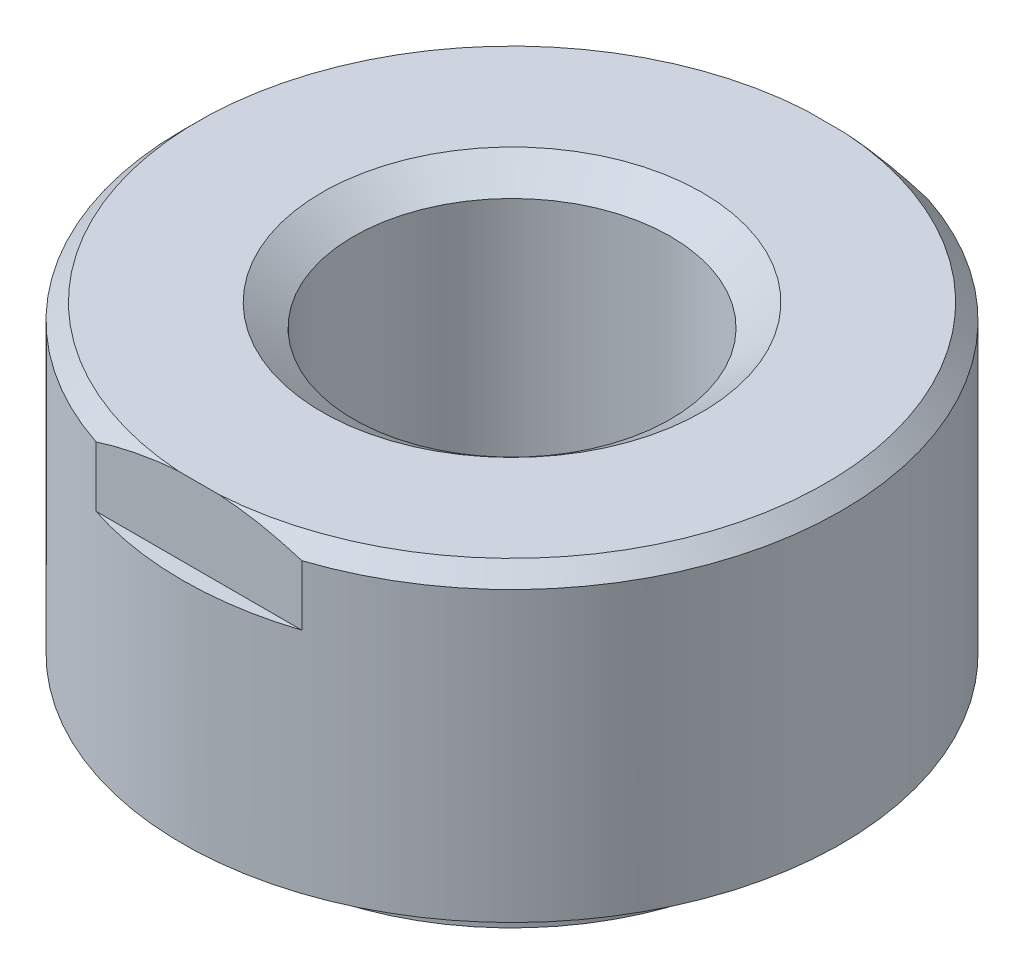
ISO-10303-21;
HEADER;
FILE_DESCRIPTION(('STEP AP214'),'2;1');
FILE_NAME('part.step','',(''),(''),'','','');
FILE_SCHEMA(('AUTOMOTIVE_DESIGN { 1 0 10303 214 1 1 1 1 }'));
ENDSEC;
DATA;
#1=APPLICATION_CONTEXT('core data for automotive mechanical design processes');
#2=APPLICATION_PROTOCOL_DEFINITION('international standard','automotive_design',2000,#1);
#3=PRODUCT_CONTEXT('',#1,'mechanical');
#4=PRODUCT('Part','Part','',(#3));
#5=PRODUCT_RELATED_PRODUCT_CATEGORY('part','',(#4));
#6=PRODUCT_DEFINITION_FORMATION('','',#4);
#7=PRODUCT_DEFINITION_CONTEXT('part definition',#1,'design');
#8=PRODUCT_DEFINITION('design','',#6,#7);
#9=PRODUCT_DEFINITION_SHAPE('','',#8);
#10=(LENGTH_UNIT() NAMED_UNIT(*) SI_UNIT(.MILLI.,.METRE.));
#11=(NAMED_UNIT(*) PLANE_ANGLE_UNIT() SI_UNIT($,.RADIAN.));
#12=(NAMED_UNIT(*) SI_UNIT($,.STERADIAN.) SOLID_ANGLE_UNIT());
#13=UNCERTAINTY_MEASURE_WITH_UNIT(LENGTH_MEASURE(1.E-05),#10,'distance_accuracy_value','');
#14=(GEOMETRIC_REPRESENTATION_CONTEXT(3) GLOBAL_UNCERTAINTY_ASSIGNED_CONTEXT((#13)) GLOBAL_UNIT_ASSIGNED_CONTEXT((#10,
#11,#12)) REPRESENTATION_CONTEXT('',''));
#15=CARTESIAN_POINT('',(0.,0.,0.));
#16=DIRECTION('',(0.,0.,1.));
#17=DIRECTION('',(1.,0.,0.));
#18=AXIS2_PLACEMENT_3D('',#15,#16,#17);
#19=CARTESIAN_POINT('',(0.,0.,0.));
#20=DIRECTION('',(0.,-1.,0.));
#21=DIRECTION('',(0.,0.,-1.));
#22=AXIS2_PLACEMENT_3D('',#19,#20,#21);
#23=CYLINDRICAL_SURFACE('',#22,7.29615);
#24=DIRECTION('',(0.,-1.,0.));
#25=VECTOR('',#24,1.);
#26=CARTESIAN_POINT('',(-7.29500746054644,-0.29464,0.129116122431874));
#27=LINE('',#26,#25);
#28=CARTESIAN_POINT('',(-7.29500746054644,0.,0.129116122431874));
#29=VERTEX_POINT('',#28);
#30=CARTESIAN_POINT('',(-7.29500746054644,-0.58928,0.129116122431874));
#31=VERTEX_POINT('',#30);
#32=EDGE_CURVE('E11',#29,#31,#27,.T.);
#33=ORIENTED_EDGE('',*,*,#32,.F.);
#34=CARTESIAN_POINT('',(0.,0.,0.));
#35=DIRECTION('',(0.,-1.,0.));
#36=DIRECTION('',(0.,0.,-1.));
#37=AXIS2_PLACEMENT_3D('',#34,#35,#36);
#38=CIRCLE('',#37,7.29615);
#39=CARTESIAN_POINT('',(-7.29500746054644,0.,-0.12911612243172));
#40=VERTEX_POINT('',#39);
#41=EDGE_CURVE('E527',#29,#40,#38,.T.);
#42=ORIENTED_EDGE('',*,*,#41,.T.);
#43=DIRECTION('',(0.,-1.,0.));
#44=VECTOR('',#43,1.);
#45=CARTESIAN_POINT('',(-7.29500746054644,-0.29464,-0.12911612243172));
#46=LINE('',#45,#44);
#47=CARTESIAN_POINT('',(-7.29500746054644,-0.58928,-0.12911612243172));
#48=VERTEX_POINT('',#47);
#49=EDGE_CURVE('E908',#48,#40,#46,.F.);
#50=ORIENTED_EDGE('',*,*,#49,.F.);
#51=CARTESIAN_POINT('',(0.,-0.58928,0.));
#52=DIRECTION('',(0.,-1.,0.));
#53=DIRECTION('',(0.,0.,-1.));
#54=AXIS2_PLACEMENT_3D('',#51,#52,#53);
#55=CIRCLE('',#54,7.29615);
#56=EDGE_CURVE('E529',#31,#48,#55,.T.);
#57=ORIENTED_EDGE('',*,*,#56,.F.);
#58=EDGE_LOOP('',(#33,#42,#50,#57));
#59=FACE_BOUND('',#58,.T.);
#60=ADVANCED_FACE('F33',(#59),#23,.T.);
#61=DIRECTION('',(0.,-1.,0.));
#62=VECTOR('',#61,1.);
#63=CARTESIAN_POINT('',(-6.25310372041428,-0.29464,3.75932157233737));
#64=LINE('',#63,#62);
#65=CARTESIAN_POINT('',(-6.25310372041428,0.,3.75932157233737));
#66=VERTEX_POINT('',#65);
#67=CARTESIAN_POINT('',(-6.25310372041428,-0.58928,3.75932157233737));
#68=VERTEX_POINT('',#67);
#69=EDGE_CURVE('E657',#66,#68,#64,.T.);
#70=ORIENTED_EDGE('',*,*,#69,.F.);
#71=CARTESIAN_POINT('',(-6.38221984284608,0.,3.53568588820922));
#72=VERTEX_POINT('',#71);
#73=EDGE_CURVE('E540',#66,#72,#38,.T.);
#74=ORIENTED_EDGE('',*,*,#73,.T.);
#75=DIRECTION('',(0.,-1.,0.));
#76=VECTOR('',#75,1.);
#77=CARTESIAN_POINT('',(-6.38221984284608,-0.29464,3.53568588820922));
#78=LINE('',#77,#76);
#79=CARTESIAN_POINT('',(-6.38221984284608,-0.58928,3.53568588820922));
#80=VERTEX_POINT('',#79);
#81=EDGE_CURVE('E655',#80,#72,#78,.F.);
#82=ORIENTED_EDGE('',*,*,#81,.F.);
#83=EDGE_CURVE('E685',#68,#80,#55,.T.);
#84=ORIENTED_EDGE('',*,*,#83,.F.);
#85=EDGE_LOOP('',(#70,#74,#82,#84));
#86=FACE_BOUND('',#85,.T.);
#87=ADVANCED_FACE('F516',(#86),#23,.T.);
#88=DIRECTION('',(0.,-1.,0.));
#89=VECTOR('',#88,1.);
#90=CARTESIAN_POINT('',(-7.07985382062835,-0.29464,1.7633702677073));
#91=LINE('',#90,#89);
#92=CARTESIAN_POINT('',(-7.07985382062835,-0.58928,1.7633702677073));
#93=VERTEX_POINT('',#92);
#94=CARTESIAN_POINT('',(-7.07985382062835,0.,1.7633702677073));
#95=VERTEX_POINT('',#94);
#96=EDGE_CURVE('E42',#93,#95,#91,.F.);
#97=ORIENTED_EDGE('',*,*,#96,.F.);
#98=CARTESIAN_POINT('',(-7.01301839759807,-0.58928,2.01280346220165));
#99=VERTEX_POINT('',#98);
#100=EDGE_CURVE('E683',#99,#93,#55,.T.);
#101=ORIENTED_EDGE('',*,*,#100,.F.);
#102=DIRECTION('',(0.,-1.,0.));
#103=VECTOR('',#102,1.);
#104=CARTESIAN_POINT('',(-7.01301839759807,-0.29464,2.01280346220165));
#105=LINE('',#104,#103);
#106=CARTESIAN_POINT('',(-7.01301839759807,0.,2.01280346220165));
#107=VERTEX_POINT('',#106);
#108=EDGE_CURVE('E668',#107,#99,#105,.T.);
#109=ORIENTED_EDGE('',*,*,#108,.F.);
#110=EDGE_CURVE('E537',#107,#95,#38,.T.);
#111=ORIENTED_EDGE('',*,*,#110,.T.);
#112=EDGE_LOOP('',(#97,#101,#109,#111));
#113=FACE_BOUND('',#112,.T.);
#114=ADVANCED_FACE('F521',(#113),#23,.T.);
#115=DIRECTION('',(0.,-1.,0.));
#116=VECTOR('',#115,1.);
#117=CARTESIAN_POINT('',(-1.76337026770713,-0.29464,7.0798538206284));
#118=LINE('',#117,#116);
#119=CARTESIAN_POINT('',(-1.76337026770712,0.,7.0798538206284));
#120=VERTEX_POINT('',#119);
#121=CARTESIAN_POINT('',(-1.76337026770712,-0.58928,7.0798538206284));
#122=VERTEX_POINT('',#121);
#123=EDGE_CURVE('E669',#120,#122,#118,.T.);
#124=ORIENTED_EDGE('',*,*,#123,.F.);
#125=CARTESIAN_POINT('',(-2.01280346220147,0.,7.01301839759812));
#126=VERTEX_POINT('',#125);
#127=EDGE_CURVE('E627',#120,#126,#38,.T.);
#128=ORIENTED_EDGE('',*,*,#127,.T.);
#129=DIRECTION('',(0.,-1.,0.));
#130=VECTOR('',#129,1.);
#131=CARTESIAN_POINT('',(-2.01280346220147,-0.29464,7.01301839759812));
#132=LINE('',#131,#130);
#133=CARTESIAN_POINT('',(-2.01280346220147,-0.58928,7.01301839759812));
#134=VERTEX_POINT('',#133);
#135=EDGE_CURVE('E983',#134,#126,#132,.F.);
#136=ORIENTED_EDGE('',*,*,#135,.F.);
#137=EDGE_CURVE('E413',#122,#134,#55,.T.);
#138=ORIENTED_EDGE('',*,*,#137,.F.);
#139=EDGE_LOOP('',(#124,#128,#136,#138));
#140=FACE_BOUND('',#139,.T.);
#141=ADVANCED_FACE('F1130',(#140),#23,.T.);
#142=DIRECTION('',(0.,-1.,0.));
#143=VECTOR('',#142,1.);
#144=CARTESIAN_POINT('',(-3.53568588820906,-0.29464,6.38221984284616));
#145=LINE('',#144,#143);
#146=CARTESIAN_POINT('',(-3.53568588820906,0.,6.38221984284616));
#147=VERTEX_POINT('',#146);
#148=CARTESIAN_POINT('',(-3.53568588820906,-0.58928,6.38221984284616));
#149=VERTEX_POINT('',#148);
#150=EDGE_CURVE('E986',#147,#149,#145,.T.);
#151=ORIENTED_EDGE('',*,*,#150,.F.);
#152=CARTESIAN_POINT('',(-3.75932157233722,0.,6.25310372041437));
#153=VERTEX_POINT('',#152);
#154=EDGE_CURVE('E633',#147,#153,#38,.T.);
#155=ORIENTED_EDGE('',*,*,#154,.T.);
#156=DIRECTION('',(0.,-1.,0.));
#157=VECTOR('',#156,1.);
#158=CARTESIAN_POINT('',(-3.75932157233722,-0.29464,6.25310372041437));
#159=LINE('',#158,#157);
#160=CARTESIAN_POINT('',(-3.75932157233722,-0.58928,6.25310372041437));
#161=VERTEX_POINT('',#160);
#162=EDGE_CURVE('E978',#161,#153,#159,.F.);
#163=ORIENTED_EDGE('',*,*,#162,.F.);
#164=EDGE_CURVE('E1110',#149,#161,#55,.T.);
#165=ORIENTED_EDGE('',*,*,#164,.F.);
#166=EDGE_LOOP('',(#151,#155,#163,#165));
#167=FACE_BOUND('',#166,.T.);
#168=ADVANCED_FACE('F1126',(#167),#23,.T.);
#169=DIRECTION('',(0.,-1.,0.));
#170=VECTOR('',#169,1.);
#171=CARTESIAN_POINT('',(-5.24964812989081,-0.29464,5.06705035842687));
#172=LINE('',#171,#170);
#173=CARTESIAN_POINT('',(-5.24964812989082,-0.58928,5.06705035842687));
#174=VERTEX_POINT('',#173);
#175=CARTESIAN_POINT('',(-5.24964812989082,0.,5.06705035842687));
#176=VERTEX_POINT('',#175);
#177=EDGE_CURVE('E671',#174,#176,#172,.F.);
#178=ORIENTED_EDGE('',*,*,#177,.F.);
#179=CARTESIAN_POINT('',(-5.06705035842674,-0.58928,5.24964812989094));
#180=VERTEX_POINT('',#179);
#181=EDGE_CURVE('E1107',#180,#174,#55,.T.);
#182=ORIENTED_EDGE('',*,*,#181,.F.);
#183=DIRECTION('',(0.,-1.,0.));
#184=VECTOR('',#183,1.);
#185=CARTESIAN_POINT('',(-5.06705035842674,-0.29464,5.24964812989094));
#186=LINE('',#185,#184);
#187=CARTESIAN_POINT('',(-5.06705035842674,0.,5.24964812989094));
#188=VERTEX_POINT('',#187);
#189=EDGE_CURVE('E981',#188,#180,#186,.T.);
#190=ORIENTED_EDGE('',*,*,#189,.F.);
#191=EDGE_CURVE('E639',#188,#176,#38,.T.);
#192=ORIENTED_EDGE('',*,*,#191,.T.);
#193=EDGE_LOOP('',(#178,#182,#190,#192));
#194=FACE_BOUND('',#193,.T.);
#195=ADVANCED_FACE('F1106',(#194),#23,.T.);
#196=DIRECTION('',(0.,-1.,0.));
#197=VECTOR('',#196,1.);
#198=CARTESIAN_POINT('',(-3.75932157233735,-0.29464,-6.25310372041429));
#199=LINE('',#198,#197);
#200=CARTESIAN_POINT('',(-3.75932157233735,0.,-6.25310372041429));
#201=VERTEX_POINT('',#200);
#202=CARTESIAN_POINT('',(-3.75932157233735,-0.58928,-6.25310372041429));
#203=VERTEX_POINT('',#202);
#204=EDGE_CURVE('E976',#201,#203,#199,.T.);
#205=ORIENTED_EDGE('',*,*,#204,.F.);
#206=CARTESIAN_POINT('',(-3.53568588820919,0.,-6.38221984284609));
#207=VERTEX_POINT('',#206);
#208=EDGE_CURVE('E553',#201,#207,#38,.T.);
#209=ORIENTED_EDGE('',*,*,#208,.T.);
#210=DIRECTION('',(0.,-1.,0.));
#211=VECTOR('',#210,1.);
#212=CARTESIAN_POINT('',(-3.53568588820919,-0.29464,-6.38221984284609));
#213=LINE('',#212,#211);
#214=CARTESIAN_POINT('',(-3.53568588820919,-0.58928,-6.38221984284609));
#215=VERTEX_POINT('',#214);
#216=EDGE_CURVE('E968',#215,#207,#213,.F.);
#217=ORIENTED_EDGE('',*,*,#216,.F.);
#218=EDGE_CURVE('E924',#203,#215,#55,.T.);
#219=ORIENTED_EDGE('',*,*,#218,.F.);
#220=EDGE_LOOP('',(#205,#209,#217,#219));
#221=FACE_BOUND('',#220,.T.);
#222=ADVANCED_FACE('F1120',(#221),#23,.T.);
#223=DIRECTION('',(0.,-1.,0.));
#224=VECTOR('',#223,1.);
#225=CARTESIAN_POINT('',(-2.01280346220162,-0.29464,-7.01301839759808));
#226=LINE('',#225,#224);
#227=CARTESIAN_POINT('',(-2.01280346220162,0.,-7.01301839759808));
#228=VERTEX_POINT('',#227);
#229=CARTESIAN_POINT('',(-2.01280346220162,-0.58928,-7.01301839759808));
#230=VERTEX_POINT('',#229);
#231=EDGE_CURVE('E971',#228,#230,#226,.T.);
#232=ORIENTED_EDGE('',*,*,#231,.F.);
#233=CARTESIAN_POINT('',(-1.76337026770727,0.,-7.07985382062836));
#234=VERTEX_POINT('',#233);
#235=EDGE_CURVE('E559',#228,#234,#38,.T.);
#236=ORIENTED_EDGE('',*,*,#235,.T.);
#237=DIRECTION('',(0.,-1.,0.));
#238=VECTOR('',#237,1.);
#239=CARTESIAN_POINT('',(-1.76337026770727,-0.29464,-7.07985382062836));
#240=LINE('',#239,#238);
#241=CARTESIAN_POINT('',(-1.76337026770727,-0.58928,-7.07985382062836));
#242=VERTEX_POINT('',#241);
#243=EDGE_CURVE('E1030',#242,#234,#240,.F.);
#244=ORIENTED_EDGE('',*,*,#243,.F.);
#245=EDGE_CURVE('E928',#230,#242,#55,.T.);
#246=ORIENTED_EDGE('',*,*,#245,.F.);
#247=EDGE_LOOP('',(#232,#236,#244,#246));
#248=FACE_BOUND('',#247,.T.);
#249=ADVANCED_FACE('F1083',(#248),#23,.T.);
#250=DIRECTION('',(0.,-1.,0.));
#251=VECTOR('',#250,1.);
#252=CARTESIAN_POINT('',(-7.07985382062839,-0.29464,-1.76337026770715));
#253=LINE('',#252,#251);
#254=CARTESIAN_POINT('',(-7.07985382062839,0.,-1.76337026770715));
#255=VERTEX_POINT('',#254);
#256=CARTESIAN_POINT('',(-7.07985382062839,-0.58928,-1.76337026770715));
#257=VERTEX_POINT('',#256);
#258=EDGE_CURVE('E966',#255,#257,#253,.T.);
#259=ORIENTED_EDGE('',*,*,#258,.F.);
#260=CARTESIAN_POINT('',(-7.01301839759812,0.,-2.0128034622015));
#261=VERTEX_POINT('',#260);
#262=EDGE_CURVE('E538',#255,#261,#38,.T.);
#263=ORIENTED_EDGE('',*,*,#262,.T.);
#264=DIRECTION('',(0.,-1.,0.));
#265=VECTOR('',#264,1.);
#266=CARTESIAN_POINT('',(-7.01301839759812,-0.29464,-2.0128034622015));
#267=LINE('',#266,#265);
#268=CARTESIAN_POINT('',(-7.01301839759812,-0.58928,-2.0128034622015));
#269=VERTEX_POINT('',#268);
#270=EDGE_CURVE('E909',#269,#261,#267,.F.);
#271=ORIENTED_EDGE('',*,*,#270,.F.);
#272=EDGE_CURVE('E917',#257,#269,#55,.T.);
#273=ORIENTED_EDGE('',*,*,#272,.F.);
#274=EDGE_LOOP('',(#259,#263,#271,#273));
#275=FACE_BOUND('',#274,.T.);
#276=ADVANCED_FACE('F1112',(#275),#23,.T.);
#277=DIRECTION('',(0.,-1.,0.));
#278=VECTOR('',#277,1.);
#279=CARTESIAN_POINT('',(-6.38221984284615,-0.29464,-3.53568588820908));
#280=LINE('',#279,#278);
#281=CARTESIAN_POINT('',(-6.38221984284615,0.,-3.53568588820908));
#282=VERTEX_POINT('',#281);
#283=CARTESIAN_POINT('',(-6.38221984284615,-0.58928,-3.53568588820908));
#284=VERTEX_POINT('',#283);
#285=EDGE_CURVE('E902',#282,#284,#280,.T.);
#286=ORIENTED_EDGE('',*,*,#285,.F.);
#287=CARTESIAN_POINT('',(-6.25310372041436,0.,-3.75932157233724));
#288=VERTEX_POINT('',#287);
#289=EDGE_CURVE('E542',#282,#288,#38,.T.);
#290=ORIENTED_EDGE('',*,*,#289,.T.);
#291=DIRECTION('',(0.,-1.,0.));
#292=VECTOR('',#291,1.);
#293=CARTESIAN_POINT('',(-6.25310372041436,-0.29464,-3.75932157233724));
#294=LINE('',#293,#292);
#295=CARTESIAN_POINT('',(-6.25310372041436,-0.58928,-3.75932157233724));
#296=VERTEX_POINT('',#295);
#297=EDGE_CURVE('E921',#296,#288,#294,.F.);
#298=ORIENTED_EDGE('',*,*,#297,.F.);
#299=EDGE_CURVE('E914',#284,#296,#55,.T.);
#300=ORIENTED_EDGE('',*,*,#299,.F.);
#301=EDGE_LOOP('',(#286,#290,#298,#300));
#302=FACE_BOUND('',#301,.T.);
#303=ADVANCED_FACE('F919',(#302),#23,.T.);
#304=DIRECTION('',(0.,-1.,0.));
#305=VECTOR('',#304,1.);
#306=CARTESIAN_POINT('',(-5.06705035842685,-0.29464,-5.24964812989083));
#307=LINE('',#306,#305);
#308=CARTESIAN_POINT('',(-5.06705035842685,-0.58928,-5.24964812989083));
#309=VERTEX_POINT('',#308);
#310=CARTESIAN_POINT('',(-5.06705035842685,0.,-5.24964812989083));
#311=VERTEX_POINT('',#310);
#312=EDGE_CURVE('E973',#309,#311,#307,.F.);
#313=ORIENTED_EDGE('',*,*,#312,.F.);
#314=CARTESIAN_POINT('',(-5.24964812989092,-0.58928,-5.06705035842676));
#315=VERTEX_POINT('',#314);
#316=EDGE_CURVE('E922',#315,#309,#55,.T.);
#317=ORIENTED_EDGE('',*,*,#316,.F.);
#318=DIRECTION('',(0.,-1.,0.));
#319=VECTOR('',#318,1.);
#320=CARTESIAN_POINT('',(-5.24964812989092,-0.29464,-5.06705035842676));
#321=LINE('',#320,#319);
#322=CARTESIAN_POINT('',(-5.24964812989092,0.,-5.06705035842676));
#323=VERTEX_POINT('',#322);
#324=EDGE_CURVE('E962',#323,#315,#321,.T.);
#325=ORIENTED_EDGE('',*,*,#324,.F.);
#326=EDGE_CURVE('E547',#323,#311,#38,.T.);
#327=ORIENTED_EDGE('',*,*,#326,.T.);
#328=EDGE_LOOP('',(#313,#317,#325,#327));
#329=FACE_BOUND('',#328,.T.);
#330=ADVANCED_FACE('F1119',(#329),#23,.T.);
#331=DIRECTION('',(0.,-1.,0.));
#332=VECTOR('',#331,1.);
#333=CARTESIAN_POINT('',(6.2531037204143,-0.29464,-3.75932157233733));
#334=LINE('',#333,#332);
#335=CARTESIAN_POINT('',(6.2531037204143,0.,-3.75932157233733));
#336=VERTEX_POINT('',#335);
#337=CARTESIAN_POINT('',(6.2531037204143,-0.58928,-3.75932157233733));
#338=VERTEX_POINT('',#337);
#339=EDGE_CURVE('E954',#336,#338,#334,.T.);
#340=ORIENTED_EDGE('',*,*,#339,.F.);
#341=CARTESIAN_POINT('',(6.3822198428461,0.,-3.53568588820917));
#342=VERTEX_POINT('',#341);
#343=EDGE_CURVE('E589',#336,#342,#38,.T.);
#344=ORIENTED_EDGE('',*,*,#343,.T.);
#345=DIRECTION('',(0.,-1.,0.));
#346=VECTOR('',#345,1.);
#347=CARTESIAN_POINT('',(6.3822198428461,-0.29464,-3.53568588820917));
#348=LINE('',#347,#346);
#349=CARTESIAN_POINT('',(6.3822198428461,-0.58928,-3.53568588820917));
#350=VERTEX_POINT('',#349);
#351=EDGE_CURVE('E1045',#350,#342,#348,.F.);
#352=ORIENTED_EDGE('',*,*,#351,.F.);
#353=EDGE_CURVE('E403',#338,#350,#55,.T.);
#354=ORIENTED_EDGE('',*,*,#353,.F.);
#355=EDGE_LOOP('',(#340,#344,#352,#354));
#356=FACE_BOUND('',#355,.T.);
#357=ADVANCED_FACE('F1051',(#356),#23,.T.);
#358=DIRECTION('',(0.,-1.,0.));
#359=VECTOR('',#358,1.);
#360=CARTESIAN_POINT('',(5.24964812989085,-0.29464,-5.06705035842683));
#361=LINE('',#360,#359);
#362=CARTESIAN_POINT('',(5.24964812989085,-0.58928,-5.06705035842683));
#363=VERTEX_POINT('',#362);
#364=CARTESIAN_POINT('',(5.24964812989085,0.,-5.06705035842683));
#365=VERTEX_POINT('',#364);
#366=EDGE_CURVE('E953',#363,#365,#361,.F.);
#367=ORIENTED_EDGE('',*,*,#366,.F.);
#368=CARTESIAN_POINT('',(5.06705035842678,-0.58928,-5.2496481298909));
#369=VERTEX_POINT('',#368);
#370=EDGE_CURVE('E406',#369,#363,#55,.T.);
#371=ORIENTED_EDGE('',*,*,#370,.F.);
#372=DIRECTION('',(0.,-1.,0.));
#373=VECTOR('',#372,1.);
#374=CARTESIAN_POINT('',(5.06705035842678,-0.29464,-5.2496481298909));
#375=LINE('',#374,#373);
#376=CARTESIAN_POINT('',(5.06705035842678,0.,-5.2496481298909));
#377=VERTEX_POINT('',#376);
#378=EDGE_CURVE('E951',#377,#369,#375,.T.);
#379=ORIENTED_EDGE('',*,*,#378,.F.);
#380=EDGE_CURVE('E583',#377,#365,#38,.T.);
#381=ORIENTED_EDGE('',*,*,#380,.T.);
#382=EDGE_LOOP('',(#367,#371,#379,#381));
#383=FACE_BOUND('',#382,.T.);
#384=ADVANCED_FACE('F950',(#383),#23,.T.);
#385=DIRECTION('',(0.,-1.,0.));
#386=VECTOR('',#385,1.);
#387=CARTESIAN_POINT('',(7.01301839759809,-0.29464,-2.0128034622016));
#388=LINE('',#387,#386);
#389=CARTESIAN_POINT('',(7.01301839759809,0.,-2.0128034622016));
#390=VERTEX_POINT('',#389);
#391=CARTESIAN_POINT('',(7.01301839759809,-0.58928,-2.0128034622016));
#392=VERTEX_POINT('',#391);
#393=EDGE_CURVE('E1048',#390,#392,#388,.T.);
#394=ORIENTED_EDGE('',*,*,#393,.F.);
#395=CARTESIAN_POINT('',(7.07985382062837,0.,-1.76337026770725));
#396=VERTEX_POINT('',#395);
#397=EDGE_CURVE('E394',#390,#396,#38,.T.);
#398=ORIENTED_EDGE('',*,*,#397,.T.);
#399=DIRECTION('',(0.,-1.,0.));
#400=VECTOR('',#399,1.);
#401=CARTESIAN_POINT('',(7.07985382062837,-0.29464,-1.76337026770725));
#402=LINE('',#401,#400);
#403=CARTESIAN_POINT('',(7.07985382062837,-0.58928,-1.76337026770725));
#404=VERTEX_POINT('',#403);
#405=EDGE_CURVE('E377',#404,#396,#402,.F.);
#406=ORIENTED_EDGE('',*,*,#405,.F.);
#407=EDGE_CURVE('E392',#392,#404,#55,.T.);
#408=ORIENTED_EDGE('',*,*,#407,.F.);
#409=EDGE_LOOP('',(#394,#398,#406,#408));
#410=FACE_BOUND('',#409,.T.);
#411=ADVANCED_FACE('F391',(#410),#23,.T.);
#412=DIRECTION('',(0.,-1.,0.));
#413=VECTOR('',#412,1.);
#414=CARTESIAN_POINT('',(3.75932157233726,-0.29464,-6.25310372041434));
#415=LINE('',#414,#413);
#416=CARTESIAN_POINT('',(3.75932157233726,-0.58928,-6.25310372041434));
#417=VERTEX_POINT('',#416);
#418=CARTESIAN_POINT('',(3.75932157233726,0.,-6.25310372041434));
#419=VERTEX_POINT('',#418);
#420=EDGE_CURVE('E957',#417,#419,#415,.F.);
#421=ORIENTED_EDGE('',*,*,#420,.F.);
#422=CARTESIAN_POINT('',(3.5356858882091,-0.58928,-6.38221984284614));
#423=VERTEX_POINT('',#422);
#424=EDGE_CURVE('E940',#423,#417,#55,.T.);
#425=ORIENTED_EDGE('',*,*,#424,.F.);
#426=DIRECTION('',(0.,-1.,0.));
#427=VECTOR('',#426,1.);
#428=CARTESIAN_POINT('',(3.5356858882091,-0.29464,-6.38221984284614));
#429=LINE('',#428,#427);
#430=CARTESIAN_POINT('',(3.5356858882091,0.,-6.38221984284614));
#431=VERTEX_POINT('',#430);
#432=EDGE_CURVE('E1043',#431,#423,#429,.T.);
#433=ORIENTED_EDGE('',*,*,#432,.F.);
#434=EDGE_CURVE('E577',#431,#419,#38,.T.);
#435=ORIENTED_EDGE('',*,*,#434,.T.);
#436=EDGE_LOOP('',(#421,#425,#433,#435));
#437=FACE_BOUND('',#436,.T.);
#438=ADVANCED_FACE('F1050',(#437),#23,.T.);
#439=DIRECTION('',(0.,-1.,0.));
#440=VECTOR('',#439,1.);
#441=CARTESIAN_POINT('',(2.01280346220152,-0.29464,-7.01301839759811));
#442=LINE('',#441,#440);
#443=CARTESIAN_POINT('',(2.01280346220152,-0.58928,-7.01301839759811));
#444=VERTEX_POINT('',#443);
#445=CARTESIAN_POINT('',(2.01280346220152,0.,-7.01301839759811));
#446=VERTEX_POINT('',#445);
#447=EDGE_CURVE('E1040',#444,#446,#442,.F.);
#448=ORIENTED_EDGE('',*,*,#447,.F.);
#449=CARTESIAN_POINT('',(1.76337026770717,-0.58928,-7.07985382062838));
#450=VERTEX_POINT('',#449);
#451=EDGE_CURVE('E936',#450,#444,#55,.T.);
#452=ORIENTED_EDGE('',*,*,#451,.F.);
#453=DIRECTION('',(0.,-1.,0.));
#454=VECTOR('',#453,1.);
#455=CARTESIAN_POINT('',(1.76337026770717,-0.29464,-7.07985382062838));
#456=LINE('',#455,#454);
#457=CARTESIAN_POINT('',(1.76337026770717,0.,-7.07985382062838));
#458=VERTEX_POINT('',#457);
#459=EDGE_CURVE('E1038',#458,#450,#456,.T.);
#460=ORIENTED_EDGE('',*,*,#459,.F.);
#461=EDGE_CURVE('E571',#458,#446,#38,.T.);
#462=ORIENTED_EDGE('',*,*,#461,.T.);
#463=EDGE_LOOP('',(#448,#452,#460,#462));
#464=FACE_BOUND('',#463,.T.);
#465=ADVANCED_FACE('F1079',(#464),#23,.T.);
#466=DIRECTION('',(0.,-1.,0.));
#467=VECTOR('',#466,1.);
#468=CARTESIAN_POINT('',(0.129116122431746,-0.29464,-7.29500746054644));
#469=LINE('',#468,#467);
#470=CARTESIAN_POINT('',(0.129116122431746,-0.58928,-7.29500746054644));
#471=VERTEX_POINT('',#470);
#472=CARTESIAN_POINT('',(0.129116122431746,0.,-7.29500746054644));
#473=VERTEX_POINT('',#472);
#474=EDGE_CURVE('E1035',#471,#473,#469,.F.);
#475=ORIENTED_EDGE('',*,*,#474,.F.);
#476=CARTESIAN_POINT('',(-0.129116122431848,-0.58928,-7.29500746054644));
#477=VERTEX_POINT('',#476);
#478=EDGE_CURVE('E932',#477,#471,#55,.T.);
#479=ORIENTED_EDGE('',*,*,#478,.F.);
#480=DIRECTION('',(0.,-1.,0.));
#481=VECTOR('',#480,1.);
#482=CARTESIAN_POINT('',(-0.129116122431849,-0.29464,-7.29500746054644));
#483=LINE('',#482,#481);
#484=CARTESIAN_POINT('',(-0.129116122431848,0.,-7.29500746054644));
#485=VERTEX_POINT('',#484);
#486=EDGE_CURVE('E1033',#485,#477,#483,.T.);
#487=ORIENTED_EDGE('',*,*,#486,.F.);
#488=EDGE_CURVE('E565',#485,#473,#38,.T.);
#489=ORIENTED_EDGE('',*,*,#488,.T.);
#490=EDGE_LOOP('',(#475,#479,#487,#489));
#491=FACE_BOUND('',#490,.T.);
#492=ADVANCED_FACE('F1075',(#491),#23,.T.);
#493=DIRECTION('',(0.,-1.,0.));
#494=VECTOR('',#493,1.);
#495=CARTESIAN_POINT('',(5.24964812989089,-0.29464,5.06705035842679));
#496=LINE('',#495,#494);
#497=CARTESIAN_POINT('',(5.24964812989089,0.,5.06705035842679));
#498=VERTEX_POINT('',#497);
#499=CARTESIAN_POINT('',(5.24964812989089,-0.58928,5.06705035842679));
#500=VERTEX_POINT('',#499);
#501=EDGE_CURVE('E1028',#498,#500,#496,.T.);
#502=ORIENTED_EDGE('',*,*,#501,.F.);
#503=CARTESIAN_POINT('',(5.06705035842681,0.,5.24964812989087));
#504=VERTEX_POINT('',#503);
#505=EDGE_CURVE('E612',#498,#504,#38,.T.);
#506=ORIENTED_EDGE('',*,*,#505,.T.);
#507=DIRECTION('',(0.,-1.,0.));
#508=VECTOR('',#507,1.);
#509=CARTESIAN_POINT('',(5.06705035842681,-0.29464,5.24964812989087));
#510=LINE('',#509,#508);
#511=CARTESIAN_POINT('',(5.06705035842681,-0.58928,5.24964812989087));
#512=VERTEX_POINT('',#511);
#513=EDGE_CURVE('E1022',#512,#504,#510,.F.);
#514=ORIENTED_EDGE('',*,*,#513,.F.);
#515=EDGE_CURVE('E1060',#500,#512,#55,.T.);
#516=ORIENTED_EDGE('',*,*,#515,.F.);
#517=EDGE_LOOP('',(#502,#506,#514,#516));
#518=FACE_BOUND('',#517,.T.);
#519=ADVANCED_FACE('F1070',(#518),#23,.T.);
#520=DIRECTION('',(0.,-1.,0.));
#521=VECTOR('',#520,1.);
#522=CARTESIAN_POINT('',(3.7593215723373,-0.29464,6.25310372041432));
#523=LINE('',#522,#521);
#524=CARTESIAN_POINT('',(3.7593215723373,0.,6.25310372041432));
#525=VERTEX_POINT('',#524);
#526=CARTESIAN_POINT('',(3.7593215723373,-0.58928,6.25310372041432));
#527=VERTEX_POINT('',#526);
#528=EDGE_CURVE('E1024',#525,#527,#523,.T.);
#529=ORIENTED_EDGE('',*,*,#528,.F.);
#530=CARTESIAN_POINT('',(3.53568588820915,0.,6.38221984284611));
#531=VERTEX_POINT('',#530);
#532=EDGE_CURVE('E617',#525,#531,#38,.T.);
#533=ORIENTED_EDGE('',*,*,#532,.T.);
#534=DIRECTION('',(0.,-1.,0.));
#535=VECTOR('',#534,1.);
#536=CARTESIAN_POINT('',(3.53568588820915,-0.29464,6.38221984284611));
#537=LINE('',#536,#535);
#538=CARTESIAN_POINT('',(3.53568588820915,-0.58928,6.38221984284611));
#539=VERTEX_POINT('',#538);
#540=EDGE_CURVE('E1005',#539,#531,#537,.F.);
#541=ORIENTED_EDGE('',*,*,#540,.F.);
#542=EDGE_CURVE('E414',#527,#539,#55,.T.);
#543=ORIENTED_EDGE('',*,*,#542,.F.);
#544=EDGE_LOOP('',(#529,#533,#541,#543));
#545=FACE_BOUND('',#544,.T.);
#546=ADVANCED_FACE('F1067',(#545),#23,.T.);
#547=DIRECTION('',(0.,-1.,0.));
#548=VECTOR('',#547,1.);
#549=CARTESIAN_POINT('',(6.25310372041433,-0.29464,3.75932157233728));
#550=LINE('',#549,#548);
#551=CARTESIAN_POINT('',(6.25310372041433,-0.58928,3.75932157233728));
#552=VERTEX_POINT('',#551);
#553=CARTESIAN_POINT('',(6.25310372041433,0.,3.75932157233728));
#554=VERTEX_POINT('',#553);
#555=EDGE_CURVE('E1026',#552,#554,#550,.F.);
#556=ORIENTED_EDGE('',*,*,#555,.F.);
#557=CARTESIAN_POINT('',(6.38221984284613,-0.58928,3.53568588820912));
#558=VERTEX_POINT('',#557);
#559=EDGE_CURVE('E1058',#558,#552,#55,.T.);
#560=ORIENTED_EDGE('',*,*,#559,.F.);
#561=DIRECTION('',(0.,-1.,0.));
#562=VECTOR('',#561,1.);
#563=CARTESIAN_POINT('',(6.38221984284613,-0.29464,3.53568588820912));
#564=LINE('',#563,#562);
#565=CARTESIAN_POINT('',(6.38221984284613,0.,3.53568588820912));
#566=VERTEX_POINT('',#565);
#567=EDGE_CURVE('E1020',#566,#558,#564,.T.);
#568=ORIENTED_EDGE('',*,*,#567,.F.);
#569=EDGE_CURVE('E606',#566,#554,#38,.T.);
#570=ORIENTED_EDGE('',*,*,#569,.T.);
#571=EDGE_LOOP('',(#556,#560,#568,#570));
#572=FACE_BOUND('',#571,.T.);
#573=ADVANCED_FACE('F1069',(#572),#23,.T.);
#574=DIRECTION('',(0.,-1.,0.));
#575=VECTOR('',#574,1.);
#576=CARTESIAN_POINT('',(7.0130183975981,-0.29464,2.01280346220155));
#577=LINE('',#576,#575);
#578=CARTESIAN_POINT('',(7.0130183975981,-0.58928,2.01280346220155));
#579=VERTEX_POINT('',#578);
#580=CARTESIAN_POINT('',(7.0130183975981,0.,2.01280346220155));
#581=VERTEX_POINT('',#580);
#582=EDGE_CURVE('E1017',#579,#581,#577,.F.);
#583=ORIENTED_EDGE('',*,*,#582,.F.);
#584=CARTESIAN_POINT('',(7.07985382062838,-0.58928,1.7633702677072));
#585=VERTEX_POINT('',#584);
#586=EDGE_CURVE('E407',#585,#579,#55,.T.);
#587=ORIENTED_EDGE('',*,*,#586,.F.);
#588=DIRECTION('',(0.,-1.,0.));
#589=VECTOR('',#588,1.);
#590=CARTESIAN_POINT('',(7.07985382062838,-0.29464,1.7633702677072));
#591=LINE('',#590,#589);
#592=CARTESIAN_POINT('',(7.07985382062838,0.,1.7633702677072));
#593=VERTEX_POINT('',#592);
#594=EDGE_CURVE('E1015',#593,#585,#591,.T.);
#595=ORIENTED_EDGE('',*,*,#594,.F.);
#596=EDGE_CURVE('E601',#593,#581,#38,.T.);
#597=ORIENTED_EDGE('',*,*,#596,.T.);
#598=EDGE_LOOP('',(#583,#587,#595,#597));
#599=FACE_BOUND('',#598,.T.);
#600=ADVANCED_FACE('F1057',(#599),#23,.T.);
#601=DIRECTION('',(0.,-1.,0.));
#602=VECTOR('',#601,1.);
#603=CARTESIAN_POINT('',(7.29500746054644,-0.29464,0.129116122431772));
#604=LINE('',#603,#602);
#605=CARTESIAN_POINT('',(7.29500746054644,-0.58928,0.129116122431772));
#606=VERTEX_POINT('',#605);
#607=CARTESIAN_POINT('',(7.29500746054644,0.,0.129116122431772));
#608=VERTEX_POINT('',#607);
#609=EDGE_CURVE('E1012',#606,#608,#604,.F.);
#610=ORIENTED_EDGE('',*,*,#609,.F.);
#611=CARTESIAN_POINT('',(7.29500746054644,-0.58928,-0.129116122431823));
#612=VERTEX_POINT('',#611);
#613=EDGE_CURVE('E404',#612,#606,#55,.T.);
#614=ORIENTED_EDGE('',*,*,#613,.F.);
#615=DIRECTION('',(0.,-1.,0.));
#616=VECTOR('',#615,1.);
#617=CARTESIAN_POINT('',(7.29500746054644,-0.29464,-0.129116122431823));
#618=LINE('',#617,#616);
#619=CARTESIAN_POINT('',(7.29500746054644,0.,-0.129116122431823));
#620=VERTEX_POINT('',#619);
#621=EDGE_CURVE('E380',#620,#612,#618,.T.);
#622=ORIENTED_EDGE('',*,*,#621,.F.);
#623=EDGE_CURVE('E599',#620,#608,#38,.T.);
#624=ORIENTED_EDGE('',*,*,#623,.T.);
#625=EDGE_LOOP('',(#610,#614,#622,#624));
#626=FACE_BOUND('',#625,.T.);
#627=ADVANCED_FACE('F1052',(#626),#23,.T.);
#628=DIRECTION('',(0.,-1.,0.));
#629=VECTOR('',#628,1.);
#630=CARTESIAN_POINT('',(2.01280346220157,-0.29464,7.01301839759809));
#631=LINE('',#630,#629);
#632=CARTESIAN_POINT('',(2.01280346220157,0.,7.0130183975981));
#633=VERTEX_POINT('',#632);
#634=CARTESIAN_POINT('',(2.01280346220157,-0.58928,7.0130183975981));
#635=VERTEX_POINT('',#634);
#636=EDGE_CURVE('E395',#633,#635,#631,.T.);
#637=ORIENTED_EDGE('',*,*,#636,.F.);
#638=CARTESIAN_POINT('',(1.76337026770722,0.,7.07985382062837));
#639=VERTEX_POINT('',#638);
#640=EDGE_CURVE('E621',#633,#639,#38,.T.);
#641=ORIENTED_EDGE('',*,*,#640,.T.);
#642=DIRECTION('',(0.,-1.,0.));
#643=VECTOR('',#642,1.);
#644=CARTESIAN_POINT('',(1.76337026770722,-0.29464,7.07985382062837));
#645=LINE('',#644,#643);
#646=CARTESIAN_POINT('',(1.76337026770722,-0.58928,7.07985382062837));
#647=VERTEX_POINT('',#646);
#648=EDGE_CURVE('E999',#647,#639,#645,.F.);
#649=ORIENTED_EDGE('',*,*,#648,.F.);
#650=EDGE_CURVE('E415',#635,#647,#55,.T.);
#651=ORIENTED_EDGE('',*,*,#650,.F.);
#652=EDGE_LOOP('',(#637,#641,#649,#651));
#653=FACE_BOUND('',#652,.T.);
#654=ADVANCED_FACE('F468',(#653),#23,.T.);
#655=CARTESIAN_POINT('',(0.,7.223125,0.));
#656=DIRECTION('',(0.,-1.,0.));
#657=DIRECTION('',(0.,0.,-1.));
#658=AXIS2_PLACEMENT_3D('',#655,#656,#657);
#659=CONICAL_SURFACE('',#658,8.255,0.78539816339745);
#660=CARTESIAN_POINT('',(-16.3839021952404,-2.6859366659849,-7.84225));
#661=CARTESIAN_POINT('',(-16.1450448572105,-2.47049196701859,-7.84225));
#662=CARTESIAN_POINT('',(-15.9057553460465,-2.25552731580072,-7.84225));
#663=CARTESIAN_POINT('',(-15.4261941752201,-1.82669583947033,-7.84225));
#664=CARTESIAN_POINT('',(-15.1859225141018,-1.61282901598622,-7.84225));
#665=CARTESIAN_POINT('',(-14.4633146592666,-0.972955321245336,-7.84225));
#666=CARTESIAN_POINT('',(-13.9793282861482,-0.548804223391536,-7.84225));
#667=CARTESIAN_POINT('',(-13.2466825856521,0.084609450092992,-7.84225));
#668=CARTESIAN_POINT('',(-13.0001298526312,0.296310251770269,-7.84225));
#669=CARTESIAN_POINT('',(-12.5053703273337,0.717760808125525,-7.84225));
#670=CARTESIAN_POINT('',(-12.2571635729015,0.927510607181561,-7.84225));
#671=CARTESIAN_POINT('',(-11.7588903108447,1.34469531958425,-7.84225));
#672=CARTESIAN_POINT('',(-11.5088241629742,1.55213066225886,-7.84225));
#673=CARTESIAN_POINT('',(-11.0064650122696,1.96433459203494,-7.84225));
#674=CARTESIAN_POINT('',(-10.7541718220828,2.16910295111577,-7.84225));
#675=CARTESIAN_POINT('',(-10.2723472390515,2.55514725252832,-7.84225));
#676=CARTESIAN_POINT('',(-10.0430593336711,2.73672681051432,-7.84225));
#677=CARTESIAN_POINT('',(-9.5820915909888,3.09682251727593,-7.84225));
#678=CARTESIAN_POINT('',(-9.35041178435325,3.27533870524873,-7.84225));
#679=CARTESIAN_POINT('',(-8.88430935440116,3.62870567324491,-7.84225));
#680=CARTESIAN_POINT('',(-8.64988704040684,3.80355686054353,-7.84225));
#681=CARTESIAN_POINT('',(-8.17783834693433,4.14886993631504,-7.84225));
#682=CARTESIAN_POINT('',(-7.9402120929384,4.31933199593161,-7.84225));
#683=CARTESIAN_POINT('',(-7.46171356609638,4.65458750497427,-7.84225));
#684=CARTESIAN_POINT('',(-7.22084899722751,4.81939191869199,-7.84225));
#685=CARTESIAN_POINT('',(-6.73476829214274,5.14250659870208,-7.84225));
#686=CARTESIAN_POINT('',(-6.48955192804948,5.30081652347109,-7.84225));
#687=CARTESIAN_POINT('',(-5.99426265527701,5.60925761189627,-7.84225));
#688=CARTESIAN_POINT('',(-5.74419356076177,5.75939487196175,-7.84225));
#689=CARTESIAN_POINT('',(-5.23828158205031,6.04957593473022,-7.84225));
#690=CARTESIAN_POINT('',(-4.98243964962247,6.18962138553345,-7.84225));
#691=CARTESIAN_POINT('',(-4.47950397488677,6.44910304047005,-7.84225));
#692=CARTESIAN_POINT('',(-4.23278900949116,6.56926850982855,-7.84225));
#693=CARTESIAN_POINT('',(-3.73294007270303,6.79560917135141,-7.84225));
#694=CARTESIAN_POINT('',(-3.47980566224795,6.90178340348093,-7.84225));
#695=CARTESIAN_POINT('',(-2.96746549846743,7.0965526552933,-7.84225));
#696=CARTESIAN_POINT('',(-2.70827536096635,7.1851882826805,-7.84225));
#697=CARTESIAN_POINT('',(-2.18364427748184,7.34138071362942,-7.84225));
#698=CARTESIAN_POINT('',(-1.91820646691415,7.40894785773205,-7.84225));
#699=CARTESIAN_POINT('',(-1.4245852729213,7.51059187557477,-7.84225));
#700=CARTESIAN_POINT('',(-1.19714892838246,7.54827524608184,-7.84225));
#701=CARTESIAN_POINT('',(-0.739901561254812,7.60431363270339,-7.84225));
#702=CARTESIAN_POINT('',(-0.510090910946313,7.62267163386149,-7.84225));
#703=CARTESIAN_POINT('',(-0.050020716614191,7.6390804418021,-7.84225));
#704=CARTESIAN_POINT('',(0.180237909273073,7.63715656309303,-7.84225));
#705=CARTESIAN_POINT('',(0.639708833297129,7.61317567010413,-7.84225));
#706=CARTESIAN_POINT('',(0.868920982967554,7.59111588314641,-7.84225));
#707=CARTESIAN_POINT('',(1.38139086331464,7.52012478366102,-7.84225));
#708=CARTESIAN_POINT('',(1.66391339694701,7.46587517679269,-7.84225));
#709=CARTESIAN_POINT('',(2.22270421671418,7.33149687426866,-7.84225));
#710=CARTESIAN_POINT('',(2.49896983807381,7.25135736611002,-7.84225));
#711=CARTESIAN_POINT('',(3.04568948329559,7.06918450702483,-7.84225));
#712=CARTESIAN_POINT('',(3.31610602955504,6.96703999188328,-7.84225));
#713=CARTESIAN_POINT('',(3.71617779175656,6.80078893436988,-7.84225));
#714=CARTESIAN_POINT('',(3.84860517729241,6.74320168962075,-7.84225));
#715=CARTESIAN_POINT('',(4.11169970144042,6.62413151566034,-7.84225));
#716=CARTESIAN_POINT('',(4.24236684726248,6.56264860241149,-7.84225));
#717=CARTESIAN_POINT('',(4.57929492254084,6.39858314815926,-7.84225));
#718=CARTESIAN_POINT('',(4.78425184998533,6.29332199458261,-7.84225));
#719=CARTESIAN_POINT('',(5.19024241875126,6.0754570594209,-7.84225));
#720=CARTESIAN_POINT('',(5.39127540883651,5.96285207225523,-7.84225));
#721=CARTESIAN_POINT('',(5.78989927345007,5.73146117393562,-7.84225));
#722=CARTESIAN_POINT('',(5.98748805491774,5.61267166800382,-7.84225));
#723=CARTESIAN_POINT('',(6.37949043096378,5.36995329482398,-7.84225));
#724=CARTESIAN_POINT('',(6.57390379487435,5.24602405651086,-7.84225));
#725=CARTESIAN_POINT('',(7.15385501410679,4.86716852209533,-7.84225));
#726=CARTESIAN_POINT('',(7.53514725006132,4.60574014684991,-7.84225));
#727=CARTESIAN_POINT('',(8.28869566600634,4.070529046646,-7.84225));
#728=CARTESIAN_POINT('',(8.66095451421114,3.79675003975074,-7.84225));
#729=CARTESIAN_POINT('',(9.40020799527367,3.23860678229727,-7.84225));
#730=CARTESIAN_POINT('',(9.76716921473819,2.95419842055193,-7.84225));
#731=CARTESIAN_POINT('',(10.4954788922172,2.37826480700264,-7.84225));
#732=CARTESIAN_POINT('',(10.8568270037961,2.08673911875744,-7.84225));
#733=CARTESIAN_POINT('',(11.574509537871,1.4985701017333,-7.84225));
#734=CARTESIAN_POINT('',(11.9308500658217,1.20193420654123,-7.84225));
#735=CARTESIAN_POINT('',(12.6398448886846,0.604314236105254,-7.84225));
#736=CARTESIAN_POINT('',(12.9924992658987,0.303330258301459,-7.84225));
#737=CARTESIAN_POINT('',(13.8575861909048,-0.442477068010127,-7.84225));
#738=CARTESIAN_POINT('',(14.3682979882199,-0.889295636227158,-7.84225));
#739=CARTESIAN_POINT('',(15.1289222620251,-1.56216393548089,-7.84225));
#740=CARTESIAN_POINT('',(15.3806975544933,-1.78611673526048,-7.84225));
#741=CARTESIAN_POINT('',(15.8831070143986,-2.23518344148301,-7.84225));
#742=CARTESIAN_POINT('',(16.1337414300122,-2.4602970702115,-7.84225));
#743=CARTESIAN_POINT('',(16.3839021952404,-2.68593666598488,-7.84225));
#744=B_SPLINE_CURVE_WITH_KNOTS('',3,(#660,#661,#662,#663,#664,#665,#666,#667,#668,#669,#670,
#671,#672,#673,#674,#675,#676,#677,#678,#679,#680,#681,#682,#683,#684,#685,#686,#687,#688,#689,
#690,#691,#692,#693,#694,#695,#696,#697,#698,#699,#700,#701,#702,#703,#704,#705,#706,#707,#708,
#709,#710,#711,#712,#713,#714,#715,#716,#717,#718,#719,#720,#721,#722,#723,#724,#725,#726,#727,
#728,#729,#730,#731,#732,#733,#734,#735,#736,#737,#738,#739,#740,#741,#742,#743),.UNSPECIFIED.,
.F.,.F.,(4,2,2,2,2,2,2,2,2,2,2,2,2,2,2,2,2,2,2,2,2,2,2,2,2,2,2,2,2,2,2,2,2,2,2,2,2,2,2,2,2,4),
(0.,0.964996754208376,1.9299949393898,3.86056836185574,4.83547056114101,5.81035053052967,
6.78504654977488,7.75982536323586,8.63724131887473,9.51464603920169,10.3919527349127,
11.2692251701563,12.1446885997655,13.0201980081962,13.8950451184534,14.7697490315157,
15.5926690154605,16.4156454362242,17.2366935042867,18.057337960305,18.748200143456,
19.4389555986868,20.1288490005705,20.8188374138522,21.6804164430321,22.542355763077,
23.4087560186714,23.8419270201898,24.2750962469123,24.9661250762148,25.6572676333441,
26.3488165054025,27.0404153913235,28.4269442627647,29.8130584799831,31.2057582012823,
32.5985435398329,33.9894501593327,35.3803256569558,37.4160083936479,38.4269020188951,
39.4375640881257),.UNSPECIFIED.);
#745=CARTESIAN_POINT('',(-2.57762292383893,7.223125,-7.84225));
#746=VERTEX_POINT('',#745);
#747=CARTESIAN_POINT('',(-0.499242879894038,7.62,-7.84225));
#748=VERTEX_POINT('',#747);
#749=EDGE_CURVE('E781',#746,#748,#744,.T.);
#750=ORIENTED_EDGE('',*,*,#749,.F.);
#751=CARTESIAN_POINT('',(0.,7.223125,0.));
#752=DIRECTION('',(0.,1.,0.));
#753=DIRECTION('',(0.,0.,1.));
#754=AXIS2_PLACEMENT_3D('',#751,#752,#753);
#755=CIRCLE('',#754,8.255);
#756=CARTESIAN_POINT('',(-2.57762292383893,7.223125,7.84225));
#757=VERTEX_POINT('',#756);
#758=EDGE_CURVE('E439',#757,#746,#755,.F.);
#759=ORIENTED_EDGE('',*,*,#758,.F.);
#760=CARTESIAN_POINT('',(16.3839021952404,-2.68593666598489,7.84225));
#761=CARTESIAN_POINT('',(16.1450448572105,-2.47049196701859,7.84225));
#762=CARTESIAN_POINT('',(15.9057553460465,-2.25552731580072,7.84225));
#763=CARTESIAN_POINT('',(15.4261941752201,-1.82669583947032,7.84225));
#764=CARTESIAN_POINT('',(15.1859225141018,-1.61282901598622,7.84225));
#765=CARTESIAN_POINT('',(14.4633146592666,-0.972955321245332,7.84225));
#766=CARTESIAN_POINT('',(13.9793282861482,-0.548804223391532,7.84225));
#767=CARTESIAN_POINT('',(13.2466825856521,0.0846094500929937,7.84225));
#768=CARTESIAN_POINT('',(13.0001298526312,0.296310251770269,7.84225));
#769=CARTESIAN_POINT('',(12.5053703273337,0.717760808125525,7.84225));
#770=CARTESIAN_POINT('',(12.2571635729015,0.927510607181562,7.84225));
#771=CARTESIAN_POINT('',(11.7588903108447,1.34469531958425,7.84225));
#772=CARTESIAN_POINT('',(11.5088241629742,1.55213066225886,7.84225));
#773=CARTESIAN_POINT('',(11.0064650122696,1.96433459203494,7.84225));
#774=CARTESIAN_POINT('',(10.7541718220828,2.16910295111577,7.84225));
#775=CARTESIAN_POINT('',(10.2723472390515,2.55514725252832,7.84225));
#776=CARTESIAN_POINT('',(10.0430593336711,2.73672681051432,7.84225));
#777=CARTESIAN_POINT('',(9.5820915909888,3.09682251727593,7.84225));
#778=CARTESIAN_POINT('',(9.35041178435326,3.27533870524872,7.84225));
#779=CARTESIAN_POINT('',(8.88430935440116,3.62870567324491,7.84225));
#780=CARTESIAN_POINT('',(8.64988704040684,3.80355686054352,7.84225));
#781=CARTESIAN_POINT('',(8.17783834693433,4.14886993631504,7.84225));
#782=CARTESIAN_POINT('',(7.94021209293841,4.3193319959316,7.84225));
#783=CARTESIAN_POINT('',(7.46171356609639,4.65458750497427,7.84225));
#784=CARTESIAN_POINT('',(7.22084899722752,4.81939191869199,7.84225));
#785=CARTESIAN_POINT('',(6.73476829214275,5.14250659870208,7.84225));
#786=CARTESIAN_POINT('',(6.48955192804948,5.30081652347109,7.84225));
#787=CARTESIAN_POINT('',(5.99426265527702,5.60925761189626,7.84225));
#788=CARTESIAN_POINT('',(5.74419356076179,5.75939487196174,7.84225));
#789=CARTESIAN_POINT('',(5.23828158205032,6.04957593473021,7.84225));
#790=CARTESIAN_POINT('',(4.98243964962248,6.18962138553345,7.84225));
#791=CARTESIAN_POINT('',(4.47950397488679,6.44910304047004,7.84225));
#792=CARTESIAN_POINT('',(4.23278900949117,6.56926850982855,7.84225));
#793=CARTESIAN_POINT('',(3.73294007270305,6.7956091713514,7.84225));
#794=CARTESIAN_POINT('',(3.47980566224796,6.90178340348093,7.84225));
#795=CARTESIAN_POINT('',(2.96746549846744,7.09655265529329,7.84225));
#796=CARTESIAN_POINT('',(2.70827536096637,7.18518828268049,7.84225));
#797=CARTESIAN_POINT('',(2.18364427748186,7.34138071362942,7.84225));
#798=CARTESIAN_POINT('',(1.91820646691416,7.40894785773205,7.84225));
#799=CARTESIAN_POINT('',(1.42458527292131,7.51059187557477,7.84225));
#800=CARTESIAN_POINT('',(1.19714892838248,7.54827524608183,7.84225));
#801=CARTESIAN_POINT('',(0.739901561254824,7.60431363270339,7.84225));
#802=CARTESIAN_POINT('',(0.510090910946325,7.62267163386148,7.84225));
#803=CARTESIAN_POINT('',(0.0500207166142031,7.6390804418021,7.84225));
#804=CARTESIAN_POINT('',(-0.180237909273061,7.63715656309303,7.84225));
#805=CARTESIAN_POINT('',(-0.639708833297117,7.61317567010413,7.84225));
#806=CARTESIAN_POINT('',(-0.868920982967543,7.59111588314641,7.84225));
#807=CARTESIAN_POINT('',(-1.38139086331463,7.52012478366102,7.84225));
#808=CARTESIAN_POINT('',(-1.663913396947,7.4658751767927,7.84225));
#809=CARTESIAN_POINT('',(-2.22270421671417,7.33149687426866,7.84225));
#810=CARTESIAN_POINT('',(-2.4989698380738,7.25135736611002,7.84225));
#811=CARTESIAN_POINT('',(-3.04568948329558,7.06918450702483,7.84225));
#812=CARTESIAN_POINT('',(-3.31610602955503,6.96703999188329,7.84225));
#813=CARTESIAN_POINT('',(-3.71617779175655,6.80078893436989,7.84225));
#814=CARTESIAN_POINT('',(-3.84860517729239,6.74320168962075,7.84225));
#815=CARTESIAN_POINT('',(-4.11169970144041,6.62413151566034,7.84225));
#816=CARTESIAN_POINT('',(-4.24236684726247,6.5626486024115,7.84225));
#817=CARTESIAN_POINT('',(-4.57929492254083,6.39858314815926,7.84225));
#818=CARTESIAN_POINT('',(-4.78425184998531,6.29332199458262,7.84225));
#819=CARTESIAN_POINT('',(-5.19024241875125,6.0754570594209,7.84225));
#820=CARTESIAN_POINT('',(-5.3912754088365,5.96285207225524,7.84225));
#821=CARTESIAN_POINT('',(-5.78989927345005,5.73146117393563,7.84225));
#822=CARTESIAN_POINT('',(-5.98748805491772,5.61267166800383,7.84225));
#823=CARTESIAN_POINT('',(-6.37949043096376,5.36995329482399,7.84225));
#824=CARTESIAN_POINT('',(-6.57390379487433,5.24602405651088,7.84225));
#825=CARTESIAN_POINT('',(-7.15385501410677,4.86716852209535,7.84225));
#826=CARTESIAN_POINT('',(-7.53514725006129,4.60574014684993,7.84225));
#827=CARTESIAN_POINT('',(-8.28869566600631,4.07052904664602,7.84225));
#828=CARTESIAN_POINT('',(-8.66095451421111,3.79675003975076,7.84225));
#829=CARTESIAN_POINT('',(-9.40020799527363,3.23860678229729,7.84225));
#830=CARTESIAN_POINT('',(-9.76716921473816,2.95419842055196,7.84225));
#831=CARTESIAN_POINT('',(-10.4954788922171,2.37826480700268,7.84225));
#832=CARTESIAN_POINT('',(-10.856827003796,2.08673911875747,7.84225));
#833=CARTESIAN_POINT('',(-11.574509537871,1.49857010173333,7.84225));
#834=CARTESIAN_POINT('',(-11.9308500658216,1.20193420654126,7.84225));
#835=CARTESIAN_POINT('',(-12.6398448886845,0.604314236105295,7.84225));
#836=CARTESIAN_POINT('',(-12.9924992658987,0.303330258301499,7.84225));
#837=CARTESIAN_POINT('',(-13.8575861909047,-0.442477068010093,7.84225));
#838=CARTESIAN_POINT('',(-14.3682979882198,-0.889295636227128,7.84225));
#839=CARTESIAN_POINT('',(-15.1289222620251,-1.56216393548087,7.84225));
#840=CARTESIAN_POINT('',(-15.3806975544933,-1.78611673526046,7.84225));
#841=CARTESIAN_POINT('',(-15.8831070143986,-2.235183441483,7.84225));
#842=CARTESIAN_POINT('',(-16.1337414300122,-2.46029707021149,7.84225));
#843=CARTESIAN_POINT('',(-16.3839021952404,-2.68593666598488,7.84225));
#844=B_SPLINE_CURVE_WITH_KNOTS('',3,(#760,#761,#762,#763,#764,#765,#766,#767,#768,#769,#770,
#771,#772,#773,#774,#775,#776,#777,#778,#779,#780,#781,#782,#783,#784,#785,#786,#787,#788,#789,
#790,#791,#792,#793,#794,#795,#796,#797,#798,#799,#800,#801,#802,#803,#804,#805,#806,#807,#808,
#809,#810,#811,#812,#813,#814,#815,#816,#817,#818,#819,#820,#821,#822,#823,#824,#825,#826,#827,
#828,#829,#830,#831,#832,#833,#834,#835,#836,#837,#838,#839,#840,#841,#842,#843),.UNSPECIFIED.,
.F.,.F.,(4,2,2,2,2,2,2,2,2,2,2,2,2,2,2,2,2,2,2,2,2,2,2,2,2,2,2,2,2,2,2,2,2,2,2,2,2,2,2,2,2,4),
(0.,0.964996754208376,1.92999493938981,3.86056836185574,4.83547056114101,5.81035053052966,
6.78504654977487,7.75982536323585,8.63724131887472,9.51464603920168,10.3919527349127,
11.2692251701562,12.1446885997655,13.0201980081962,13.8950451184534,14.7697490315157,
15.5926690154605,16.4156454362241,17.2366935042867,18.057337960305,18.7482001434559,
19.4389555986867,20.1288490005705,20.8188374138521,21.6804164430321,22.5423557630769,
23.4087560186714,23.8419270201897,24.2750962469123,24.9661250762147,25.6572676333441,
26.3488165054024,27.0404153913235,28.4269442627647,29.8130584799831,31.2057582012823,
32.5985435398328,33.9894501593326,35.3803256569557,37.4160083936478,38.426902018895,
39.4375640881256),.UNSPECIFIED.);
#845=CARTESIAN_POINT('',(-0.499242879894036,7.62,7.84225));
#846=VERTEX_POINT('',#845);
#847=EDGE_CURVE('E446',#846,#757,#844,.T.);
#848=ORIENTED_EDGE('',*,*,#847,.F.);
#849=CARTESIAN_POINT('',(0.,7.62,0.));
#850=DIRECTION('',(0.,1.,0.));
#851=DIRECTION('',(0.,0.,1.));
#852=AXIS2_PLACEMENT_3D('',#849,#850,#851);
#853=CIRCLE('',#852,7.858125);
#854=EDGE_CURVE('E442',#748,#846,#853,.T.);
#855=ORIENTED_EDGE('',*,*,#854,.F.);
#856=EDGE_LOOP('',(#750,#759,#848,#855));
#857=FACE_BOUND('',#856,.T.);
#858=ADVANCED_FACE('F508',(#857),#659,.T.);
#859=CARTESIAN_POINT('',(7.29615,0.,0.));
#860=DIRECTION('',(0.,-1.,0.));
#861=DIRECTION('',(0.,0.,-1.));
#862=AXIS2_PLACEMENT_3D('',#859,#860,#861);
#863=PLANE('',#862);
#864=ORIENTED_EDGE('',*,*,#41,.F.);
#865=CARTESIAN_POINT('',(-7.23373042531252,0.,0.952338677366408));
#866=DIRECTION('',(0.,-1.,0.));
#867=DIRECTION('',(1.,0.,0.));
#868=AXIS2_PLACEMENT_3D('',#865,#866,#867);
#869=CIRCLE('',#868,0.8255);
#870=EDGE_CURVE('E532',#29,#95,#869,.T.);
#871=ORIENTED_EDGE('',*,*,#870,.T.);
#872=ORIENTED_EDGE('',*,*,#110,.F.);
#873=CARTESIAN_POINT('',(-6.74076365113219,0.,2.79211572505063));
#874=DIRECTION('',(0.,-1.,0.));
#875=DIRECTION('',(0.965925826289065,0.,-0.258819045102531));
#876=AXIS2_PLACEMENT_3D('',#873,#874,#875);
#877=CIRCLE('',#876,0.8255);
#878=EDGE_CURVE('E660',#107,#72,#877,.T.);
#879=ORIENTED_EDGE('',*,*,#878,.T.);
#880=ORIENTED_EDGE('',*,*,#73,.F.);
#881=CARTESIAN_POINT('',(-5.78842497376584,0.,4.44161470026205));
#882=DIRECTION('',(0.,-1.,0.));
#883=DIRECTION('',(0.866025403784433,0.,-0.50000000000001));
#884=AXIS2_PLACEMENT_3D('',#881,#882,#883);
#885=CIRCLE('',#884,0.8255);
#886=EDGE_CURVE('E658',#66,#176,#885,.T.);
#887=ORIENTED_EDGE('',*,*,#886,.T.);
#888=ORIENTED_EDGE('',*,*,#191,.F.);
#889=CARTESIAN_POINT('',(-4.4416147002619,0.,5.78842497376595));
#890=DIRECTION('',(0.,-1.,0.));
#891=DIRECTION('',(0.707106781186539,0.,-0.707106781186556));
#892=AXIS2_PLACEMENT_3D('',#889,#890,#891);
#893=CIRCLE('',#892,0.8255);
#894=EDGE_CURVE('E1099',#188,#153,#893,.T.);
#895=ORIENTED_EDGE('',*,*,#894,.T.);
#896=ORIENTED_EDGE('',*,*,#154,.F.);
#897=CARTESIAN_POINT('',(-2.79211572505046,0.,6.74076365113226));
#898=DIRECTION('',(0.,-1.,0.));
#899=DIRECTION('',(0.499999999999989,0.,-0.866025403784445));
#900=AXIS2_PLACEMENT_3D('',#897,#898,#899);
#901=CIRCLE('',#900,0.8255);
#902=EDGE_CURVE('E1092',#147,#126,#901,.T.);
#903=ORIENTED_EDGE('',*,*,#902,.T.);
#904=ORIENTED_EDGE('',*,*,#127,.F.);
#905=CARTESIAN_POINT('',(-0.952338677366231,0.,7.23373042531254));
#906=DIRECTION('',(0.,-1.,0.));
#907=DIRECTION('',(0.258819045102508,0.,-0.965925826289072));
#908=AXIS2_PLACEMENT_3D('',#905,#906,#907);
#909=CIRCLE('',#908,0.8255);
#910=CARTESIAN_POINT('',(-0.129116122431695,0.,7.29500746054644));
#911=VERTEX_POINT('',#910);
#912=EDGE_CURVE('E988',#120,#911,#909,.T.);
#913=ORIENTED_EDGE('',*,*,#912,.T.);
#914=CARTESIAN_POINT('',(0.129116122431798,0.,7.29500746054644));
#915=VERTEX_POINT('',#914);
#916=EDGE_CURVE('E416',#915,#911,#38,.T.);
#917=ORIENTED_EDGE('',*,*,#916,.F.);
#918=CARTESIAN_POINT('',(0.952338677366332,0.,7.23373042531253));
#919=DIRECTION('',(0.,-1.,0.));
#920=DIRECTION('',(0.,0.,-1.));
#921=AXIS2_PLACEMENT_3D('',#918,#919,#920);
#922=CIRCLE('',#921,0.8255);
#923=EDGE_CURVE('E735',#915,#639,#922,.T.);
#924=ORIENTED_EDGE('',*,*,#923,.T.);
#925=ORIENTED_EDGE('',*,*,#640,.F.);
#926=CARTESIAN_POINT('',(2.79211572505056,0.,6.74076365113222));
#927=DIRECTION('',(0.,-1.,0.));
#928=DIRECTION('',(-0.258819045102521,0.,-0.965925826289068));
#929=AXIS2_PLACEMENT_3D('',#926,#927,#928);
#930=CIRCLE('',#929,0.8255);
#931=EDGE_CURVE('E730',#633,#531,#930,.T.);
#932=ORIENTED_EDGE('',*,*,#931,.T.);
#933=ORIENTED_EDGE('',*,*,#532,.F.);
#934=CARTESIAN_POINT('',(4.44161470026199,0.,5.78842497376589));
#935=DIRECTION('',(0.,-1.,0.));
#936=DIRECTION('',(-0.500000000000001,0.,-0.866025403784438));
#937=AXIS2_PLACEMENT_3D('',#934,#935,#936);
#938=CIRCLE('',#937,0.8255);
#939=EDGE_CURVE('E49',#525,#504,#938,.T.);
#940=ORIENTED_EDGE('',*,*,#939,.T.);
#941=ORIENTED_EDGE('',*,*,#505,.F.);
#942=CARTESIAN_POINT('',(5.78842497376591,0.,4.44161470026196));
#943=DIRECTION('',(0.,-1.,0.));
#944=DIRECTION('',(-0.707106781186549,0.,-0.707106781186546));
#945=AXIS2_PLACEMENT_3D('',#942,#943,#944);
#946=CIRCLE('',#945,0.8255);
#947=EDGE_CURVE('E55',#498,#554,#946,.T.);
#948=ORIENTED_EDGE('',*,*,#947,.T.);
#949=ORIENTED_EDGE('',*,*,#569,.F.);
#950=CARTESIAN_POINT('',(6.74076365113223,0.,2.79211572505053));
#951=DIRECTION('',(0.,-1.,0.));
#952=DIRECTION('',(-0.86602540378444,0.,-0.499999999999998));
#953=AXIS2_PLACEMENT_3D('',#950,#951,#952);
#954=CIRCLE('',#953,0.8255);
#955=EDGE_CURVE('E691',#566,#581,#954,.T.);
#956=ORIENTED_EDGE('',*,*,#955,.T.);
#957=ORIENTED_EDGE('',*,*,#596,.F.);
#958=CARTESIAN_POINT('',(7.23373042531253,0.,0.952338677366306));
#959=DIRECTION('',(0.,-1.,0.));
#960=DIRECTION('',(-0.965925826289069,0.,-0.258819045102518));
#961=AXIS2_PLACEMENT_3D('',#958,#959,#960);
#962=CIRCLE('',#961,0.8255);
#963=EDGE_CURVE('E696',#593,#608,#962,.T.);
#964=ORIENTED_EDGE('',*,*,#963,.T.);
#965=ORIENTED_EDGE('',*,*,#623,.F.);
#966=CARTESIAN_POINT('',(7.23373042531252,0.,-0.952338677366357));
#967=DIRECTION('',(0.,-1.,0.));
#968=DIRECTION('',(-1.,0.,0.));
#969=AXIS2_PLACEMENT_3D('',#966,#967,#968);
#970=CIRCLE('',#969,0.8255);
#971=EDGE_CURVE('E385',#620,#396,#970,.T.);
#972=ORIENTED_EDGE('',*,*,#971,.T.);
#973=ORIENTED_EDGE('',*,*,#397,.F.);
#974=CARTESIAN_POINT('',(6.74076365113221,0.,-2.79211572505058));
#975=DIRECTION('',(0.,-1.,0.));
#976=DIRECTION('',(-0.965925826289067,0.,0.258819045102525));
#977=AXIS2_PLACEMENT_3D('',#974,#975,#976);
#978=CIRCLE('',#977,0.8255);
#979=EDGE_CURVE('E386',#390,#342,#978,.T.);
#980=ORIENTED_EDGE('',*,*,#979,.T.);
#981=ORIENTED_EDGE('',*,*,#343,.F.);
#982=CARTESIAN_POINT('',(5.78842497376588,0.,-4.44161470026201));
#983=DIRECTION('',(0.,-1.,0.));
#984=DIRECTION('',(-0.866025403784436,0.,0.500000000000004));
#985=AXIS2_PLACEMENT_3D('',#982,#983,#984);
#986=CIRCLE('',#985,0.8255);
#987=EDGE_CURVE('E725',#336,#365,#986,.T.);
#988=ORIENTED_EDGE('',*,*,#987,.T.);
#989=ORIENTED_EDGE('',*,*,#380,.F.);
#990=CARTESIAN_POINT('',(4.44161470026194,0.,-5.78842497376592));
#991=DIRECTION('',(0.,-1.,0.));
#992=DIRECTION('',(-0.707106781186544,0.,0.707106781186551));
#993=AXIS2_PLACEMENT_3D('',#990,#991,#992);
#994=CIRCLE('',#993,0.8255);
#995=EDGE_CURVE('E721',#377,#419,#994,.T.);
#996=ORIENTED_EDGE('',*,*,#995,.T.);
#997=ORIENTED_EDGE('',*,*,#434,.F.);
#998=CARTESIAN_POINT('',(2.79211572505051,0.,-6.74076365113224));
#999=DIRECTION('',(0.,-1.,0.));
#1000=DIRECTION('',(-0.499999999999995,0.,0.866025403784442));
#1001=AXIS2_PLACEMENT_3D('',#998,#999,#1000);
#1002=CIRCLE('',#1001,0.8255);
#1003=EDGE_CURVE('E707',#431,#446,#1002,.T.);
#1004=ORIENTED_EDGE('',*,*,#1003,.T.);
#1005=ORIENTED_EDGE('',*,*,#461,.F.);
#1006=CARTESIAN_POINT('',(0.952338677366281,0.,-7.23373042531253));
#1007=DIRECTION('',(0.,-1.,0.));
#1008=DIRECTION('',(-0.258819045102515,0.,0.96592582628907));
#1009=AXIS2_PLACEMENT_3D('',#1006,#1007,#1008);
#1010=CIRCLE('',#1009,0.8255);
#1011=EDGE_CURVE('E712',#458,#473,#1010,.T.);
#1012=ORIENTED_EDGE('',*,*,#1011,.T.);
#1013=ORIENTED_EDGE('',*,*,#488,.F.);
#1014=CARTESIAN_POINT('',(-0.952338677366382,0.,-7.23373042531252));
#1015=DIRECTION('',(0.,-1.,0.));
#1016=DIRECTION('',(0.,0.,1.));
#1017=AXIS2_PLACEMENT_3D('',#1014,#1015,#1016);
#1018=CIRCLE('',#1017,0.8255);
#1019=EDGE_CURVE('E716',#485,#234,#1018,.T.);
#1020=ORIENTED_EDGE('',*,*,#1019,.T.);
#1021=ORIENTED_EDGE('',*,*,#235,.F.);
#1022=CARTESIAN_POINT('',(-2.7921157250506,0.,-6.7407636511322));
#1023=DIRECTION('',(0.,-1.,0.));
#1024=DIRECTION('',(0.258819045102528,0.,0.965925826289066));
#1025=AXIS2_PLACEMENT_3D('',#1022,#1023,#1024);
#1026=CIRCLE('',#1025,0.8255);
#1027=EDGE_CURVE('E720',#228,#207,#1026,.T.);
#1028=ORIENTED_EDGE('',*,*,#1027,.T.);
#1029=ORIENTED_EDGE('',*,*,#208,.F.);
#1030=CARTESIAN_POINT('',(-4.44161470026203,0.,-5.78842497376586));
#1031=DIRECTION('',(0.,-1.,0.));
#1032=DIRECTION('',(0.500000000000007,0.,0.866025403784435));
#1033=AXIS2_PLACEMENT_3D('',#1030,#1031,#1032);
#1034=CIRCLE('',#1033,0.8255);
#1035=EDGE_CURVE('E1085',#201,#311,#1034,.T.);
#1036=ORIENTED_EDGE('',*,*,#1035,.T.);
#1037=ORIENTED_EDGE('',*,*,#326,.F.);
#1038=CARTESIAN_POINT('',(-5.78842497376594,0.,-4.44161470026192));
#1039=DIRECTION('',(0.,-1.,0.));
#1040=DIRECTION('',(0.707106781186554,0.,0.707106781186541));
#1041=AXIS2_PLACEMENT_3D('',#1038,#1039,#1040);
#1042=CIRCLE('',#1041,0.8255);
#1043=EDGE_CURVE('E1115',#323,#288,#1042,.T.);
#1044=ORIENTED_EDGE('',*,*,#1043,.T.);
#1045=ORIENTED_EDGE('',*,*,#289,.F.);
#1046=CARTESIAN_POINT('',(-6.74076365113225,0.,-2.79211572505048));
#1047=DIRECTION('',(0.,-1.,0.));
#1048=DIRECTION('',(0.866025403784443,0.,0.499999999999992));
#1049=AXIS2_PLACEMENT_3D('',#1046,#1047,#1048);
#1050=CIRCLE('',#1049,0.8255);
#1051=EDGE_CURVE('E906',#282,#261,#1050,.T.);
#1052=ORIENTED_EDGE('',*,*,#1051,.T.);
#1053=ORIENTED_EDGE('',*,*,#262,.F.);
#1054=CARTESIAN_POINT('',(-7.23373042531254,0.,-0.952338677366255));
#1055=DIRECTION('',(0.,-1.,0.));
#1056=DIRECTION('',(0.965925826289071,0.,0.258819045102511));
#1057=AXIS2_PLACEMENT_3D('',#1054,#1055,#1056);
#1058=CIRCLE('',#1057,0.8255);
#1059=EDGE_CURVE('E535',#255,#40,#1058,.T.);
#1060=ORIENTED_EDGE('',*,*,#1059,.T.);
#1061=EDGE_LOOP('',(#864,#871,#872,#879,#880,#887,#888,#895,#896,#903,#904,#913,#917,#924,#925,
#932,#933,#940,#941,#948,#949,#956,#957,#964,#965,#972,#973,#980,#981,#988,#989,#996,#997,#1004,
#1005,#1012,#1013,#1020,#1021,#1028,#1029,#1036,#1037,#1044,#1045,#1052,#1053,#1060));
#1062=FACE_BOUND('',#1061,.T.);
#1063=CARTESIAN_POINT('',(0.,0.,0.));
#1064=DIRECTION('',(0.,-1.,0.));
#1065=DIRECTION('',(0.,0.,-1.));
#1066=AXIS2_PLACEMENT_3D('',#1063,#1064,#1065);
#1067=CIRCLE('',#1066,8.255);
#1068=CARTESIAN_POINT('',(0.,0.,-8.255));
#1069=VERTEX_POINT('',#1068);
#1070=EDGE_CURVE('E435',#1069,#1069,#1067,.T.);
#1071=ORIENTED_EDGE('',*,*,#1070,.T.);
#1072=EDGE_LOOP('',(#1071));
#1073=FACE_BOUND('',#1072,.T.);
#1074=ADVANCED_FACE('F505',(#1062,#1073),#863,.T.);
#1075=CARTESIAN_POINT('',(0.,0.,0.));
#1076=DIRECTION('',(0.,-1.,0.));
#1077=DIRECTION('',(0.,0.,-1.));
#1078=AXIS2_PLACEMENT_3D('',#1075,#1076,#1077);
#1079=CYLINDRICAL_SURFACE('',#1078,8.255);
#1080=DIRECTION('',(0.,-1.,0.));
#1081=VECTOR('',#1080,1.);
#1082=CARTESIAN_POINT('',(-2.57762292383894,0.,-7.84225));
#1083=LINE('',#1082,#1081);
#1084=CARTESIAN_POINT('',(-2.57762292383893,5.715,-7.84225));
#1085=VERTEX_POINT('',#1084);
#1086=EDGE_CURVE('E760',#1085,#746,#1083,.F.);
#1087=ORIENTED_EDGE('',*,*,#1086,.F.);
#1088=CARTESIAN_POINT('',(0.,5.715,0.));
#1089=DIRECTION('',(0.,-1.,0.));
#1090=DIRECTION('',(0.,0.,-1.));
#1091=AXIS2_PLACEMENT_3D('',#1088,#1089,#1090);
#1092=CIRCLE('',#1091,8.255);
#1093=CARTESIAN_POINT('',(2.57762292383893,5.715,-7.84225));
#1094=VERTEX_POINT('',#1093);
#1095=EDGE_CURVE('E784',#1094,#1085,#1092,.F.);
#1096=ORIENTED_EDGE('',*,*,#1095,.F.);
#1097=DIRECTION('',(0.,-1.,0.));
#1098=VECTOR('',#1097,1.);
#1099=CARTESIAN_POINT('',(2.57762292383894,0.,-7.84225));
#1100=LINE('',#1099,#1098);
#1101=CARTESIAN_POINT('',(2.57762292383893,7.223125,-7.84225));
#1102=VERTEX_POINT('',#1101);
#1103=EDGE_CURVE('E756',#1102,#1094,#1100,.T.);
#1104=ORIENTED_EDGE('',*,*,#1103,.F.);
#1105=CARTESIAN_POINT('',(2.57762292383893,7.223125,7.84225));
#1106=VERTEX_POINT('',#1105);
#1107=EDGE_CURVE('E438',#1102,#1106,#755,.F.);
#1108=ORIENTED_EDGE('',*,*,#1107,.T.);
#1109=DIRECTION('',(0.,-1.,0.));
#1110=VECTOR('',#1109,1.);
#1111=CARTESIAN_POINT('',(2.57762292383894,0.,7.84225));
#1112=LINE('',#1111,#1110);
#1113=CARTESIAN_POINT('',(2.57762292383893,5.715,7.84225));
#1114=VERTEX_POINT('',#1113);
#1115=EDGE_CURVE('E626',#1114,#1106,#1112,.F.);
#1116=ORIENTED_EDGE('',*,*,#1115,.F.);
#1117=CARTESIAN_POINT('',(0.,5.715,0.));
#1118=DIRECTION('',(0.,1.,0.));
#1119=DIRECTION('',(0.,0.,1.));
#1120=AXIS2_PLACEMENT_3D('',#1117,#1118,#1119);
#1121=CIRCLE('',#1120,8.255);
#1122=CARTESIAN_POINT('',(-2.57762292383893,5.715,7.84225));
#1123=VERTEX_POINT('',#1122);
#1124=EDGE_CURVE('E454',#1114,#1123,#1121,.F.);
#1125=ORIENTED_EDGE('',*,*,#1124,.T.);
#1126=DIRECTION('',(0.,-1.,0.));
#1127=VECTOR('',#1126,1.);
#1128=CARTESIAN_POINT('',(-2.57762292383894,0.,7.84225));
#1129=LINE('',#1128,#1127);
#1130=EDGE_CURVE('E766',#757,#1123,#1129,.T.);
#1131=ORIENTED_EDGE('',*,*,#1130,.F.);
#1132=ORIENTED_EDGE('',*,*,#758,.T.);
#1133=EDGE_LOOP('',(#1087,#1096,#1104,#1108,#1116,#1125,#1131,#1132));
#1134=FACE_BOUND('',#1133,.T.);
#1135=ORIENTED_EDGE('',*,*,#1070,.F.);
#1136=EDGE_LOOP('',(#1135));
#1137=FACE_BOUND('',#1136,.T.);
#1138=ADVANCED_FACE('F502',(#1134,#1137),#1079,.T.);
#1139=CARTESIAN_POINT('',(8.255,7.62,0.));
#1140=DIRECTION('',(0.,1.,0.));
#1141=DIRECTION('',(0.,0.,1.));
#1142=AXIS2_PLACEMENT_3D('',#1139,#1140,#1141);
#1143=PLANE('',#1142);
#1144=CARTESIAN_POINT('',(0.,7.62,0.));
#1145=DIRECTION('',(0.,-1.,0.));
#1146=DIRECTION('',(0.,0.,-1.));
#1147=AXIS2_PLACEMENT_3D('',#1144,#1145,#1146);
#1148=CIRCLE('',#1147,4.7625);
#1149=CARTESIAN_POINT('',(0.,7.62,-4.7625));
#1150=VERTEX_POINT('',#1149);
#1151=EDGE_CURVE('E743',#1150,#1150,#1148,.T.);
#1152=ORIENTED_EDGE('',*,*,#1151,.T.);
#1153=EDGE_LOOP('',(#1152));
#1154=FACE_BOUND('',#1153,.T.);
#1155=DIRECTION('',(1.,0.,0.));
#1156=VECTOR('',#1155,1.);
#1157=CARTESIAN_POINT('',(8.255,7.62,-7.84225));
#1158=LINE('',#1157,#1156);
#1159=CARTESIAN_POINT('',(0.499242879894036,7.62,-7.84225));
#1160=VERTEX_POINT('',#1159);
#1161=EDGE_CURVE('E757',#748,#1160,#1158,.T.);
#1162=ORIENTED_EDGE('',*,*,#1161,.F.);
#1163=ORIENTED_EDGE('',*,*,#854,.T.);
#1164=DIRECTION('',(-1.,0.,0.));
#1165=VECTOR('',#1164,1.);
#1166=CARTESIAN_POINT('',(8.255,7.62,7.84225));
#1167=LINE('',#1166,#1165);
#1168=CARTESIAN_POINT('',(0.499242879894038,7.62,7.84225));
#1169=VERTEX_POINT('',#1168);
#1170=EDGE_CURVE('E762',#1169,#846,#1167,.T.);
#1171=ORIENTED_EDGE('',*,*,#1170,.F.);
#1172=EDGE_CURVE('E443',#1169,#1160,#853,.T.);
#1173=ORIENTED_EDGE('',*,*,#1172,.T.);
#1174=EDGE_LOOP('',(#1162,#1163,#1171,#1173));
#1175=FACE_BOUND('',#1174,.T.);
#1176=ADVANCED_FACE('F498',(#1154,#1175),#1143,.T.);
#1177=CARTESIAN_POINT('',(0.,0.,0.));
#1178=DIRECTION('',(0.,-1.,0.));
#1179=DIRECTION('',(0.,0.,-1.));
#1180=AXIS2_PLACEMENT_3D('',#1177,#1178,#1179);
#1181=CYLINDRICAL_SURFACE('',#1180,3.96875);
#1182=CARTESIAN_POINT('',(0.,7.06441669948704,0.));
#1183=DIRECTION('',(0.,-1.,0.));
#1184=DIRECTION('',(0.,0.,-1.));
#1185=AXIS2_PLACEMENT_3D('',#1182,#1183,#1184);
#1186=CIRCLE('',#1185,3.96875);
#1187=CARTESIAN_POINT('',(0.,7.06441669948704,-3.96875));
#1188=VERTEX_POINT('',#1187);
#1189=EDGE_CURVE('E738',#1188,#1188,#1186,.T.);
#1190=ORIENTED_EDGE('',*,*,#1189,.F.);
#1191=EDGE_LOOP('',(#1190));
#1192=FACE_BOUND('',#1191,.T.);
#1193=CARTESIAN_POINT('',(0.,-0.915076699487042,0.));
#1194=DIRECTION('',(0.,-1.,0.));
#1195=DIRECTION('',(0.,0.,-1.));
#1196=AXIS2_PLACEMENT_3D('',#1193,#1194,#1195);
#1197=CIRCLE('',#1196,3.96875);
#1198=CARTESIAN_POINT('',(0.,-0.915076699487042,-3.96875));
#1199=VERTEX_POINT('',#1198);
#1200=EDGE_CURVE('E746',#1199,#1199,#1197,.T.);
#1201=ORIENTED_EDGE('',*,*,#1200,.T.);
#1202=EDGE_LOOP('',(#1201));
#1203=FACE_BOUND('',#1202,.T.);
#1204=ADVANCED_FACE('F494',(#1192,#1203),#1181,.F.);
#1205=CARTESIAN_POINT('',(3.96875,-1.4732,0.));
#1206=DIRECTION('',(0.,-1.,0.));
#1207=DIRECTION('',(0.,0.,-1.));
#1208=AXIS2_PLACEMENT_3D('',#1205,#1206,#1207);
#1209=PLANE('',#1208);
#1210=CARTESIAN_POINT('',(0.,-1.4732,0.));
#1211=DIRECTION('',(0.,-1.,0.));
#1212=DIRECTION('',(0.,0.,-1.));
#1213=AXIS2_PLACEMENT_3D('',#1210,#1211,#1212);
#1214=CIRCLE('',#1213,4.7625);
#1215=CARTESIAN_POINT('',(0.,-1.4732,-4.7625));
#1216=VERTEX_POINT('',#1215);
#1217=EDGE_CURVE('E752',#1216,#1216,#1214,.T.);
#1218=ORIENTED_EDGE('',*,*,#1217,.F.);
#1219=EDGE_LOOP('',(#1218));
#1220=FACE_BOUND('',#1219,.T.);
#1221=CARTESIAN_POINT('',(0.,-1.4732,0.));
#1222=DIRECTION('',(0.,-1.,0.));
#1223=DIRECTION('',(0.,0.,-1.));
#1224=AXIS2_PLACEMENT_3D('',#1221,#1222,#1223);
#1225=CIRCLE('',#1224,6.3373);
#1226=CARTESIAN_POINT('',(0.,-1.4732,-6.3373));
#1227=VERTEX_POINT('',#1226);
#1228=EDGE_CURVE('E432',#1227,#1227,#1225,.T.);
#1229=ORIENTED_EDGE('',*,*,#1228,.T.);
#1230=EDGE_LOOP('',(#1229));
#1231=FACE_BOUND('',#1230,.T.);
#1232=ADVANCED_FACE('F490',(#1220,#1231),#1209,.T.);
#1233=CARTESIAN_POINT('',(0.,0.,0.));
#1234=DIRECTION('',(0.,-1.,0.));
#1235=DIRECTION('',(0.,0.,-1.));
#1236=AXIS2_PLACEMENT_3D('',#1233,#1234,#1235);
#1237=CYLINDRICAL_SURFACE('',#1236,6.3373);
#1238=CARTESIAN_POINT('',(0.,-1.3462,0.));
#1239=DIRECTION('',(0.,-1.,0.));
#1240=DIRECTION('',(0.,0.,-1.));
#1241=AXIS2_PLACEMENT_3D('',#1238,#1239,#1240);
#1242=CIRCLE('',#1241,6.3373);
#1243=CARTESIAN_POINT('',(0.,-1.3462,-6.3373));
#1244=VERTEX_POINT('',#1243);
#1245=EDGE_CURVE('E429',#1244,#1244,#1242,.T.);
#1246=ORIENTED_EDGE('',*,*,#1245,.T.);
#1247=EDGE_LOOP('',(#1246));
#1248=FACE_BOUND('',#1247,.T.);
#1249=ORIENTED_EDGE('',*,*,#1228,.F.);
#1250=EDGE_LOOP('',(#1249));
#1251=FACE_BOUND('',#1250,.T.);
#1252=ADVANCED_FACE('F486',(#1248,#1251),#1237,.T.);
#1253=CARTESIAN_POINT('',(0.,-1.3462,0.));
#1254=DIRECTION('',(0.,-1.,0.));
#1255=DIRECTION('',(0.,0.,-1.));
#1256=AXIS2_PLACEMENT_3D('',#1253,#1254,#1255);
#1257=CONICAL_SURFACE('',#1256,6.3373,0.523598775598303);
#1258=CARTESIAN_POINT('',(0.,-0.58928,0.));
#1259=DIRECTION('',(0.,-1.,0.));
#1260=DIRECTION('',(0.,0.,-1.));
#1261=AXIS2_PLACEMENT_3D('',#1258,#1259,#1260);
#1262=CIRCLE('',#1261,5.90029203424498);
#1263=CARTESIAN_POINT('',(0.,-0.58928,-5.90029203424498));
#1264=VERTEX_POINT('',#1263);
#1265=EDGE_CURVE('E426',#1264,#1264,#1262,.T.);
#1266=ORIENTED_EDGE('',*,*,#1265,.T.);
#1267=EDGE_LOOP('',(#1266));
#1268=FACE_BOUND('',#1267,.T.);
#1269=ORIENTED_EDGE('',*,*,#1245,.F.);
#1270=EDGE_LOOP('',(#1269));
#1271=FACE_BOUND('',#1270,.T.);
#1272=ADVANCED_FACE('F482',(#1268,#1271),#1257,.T.);
#1273=CARTESIAN_POINT('',(0.,0.,0.));
#1274=DIRECTION('',(0.,-1.,0.));
#1275=DIRECTION('',(0.,0.,-1.));
#1276=AXIS2_PLACEMENT_3D('',#1273,#1274,#1275);
#1277=CYLINDRICAL_SURFACE('',#1276,5.90029203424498);
#1278=CARTESIAN_POINT('',(0.,0.,0.));
#1279=DIRECTION('',(0.,-1.,0.));
#1280=DIRECTION('',(0.,0.,-1.));
#1281=AXIS2_PLACEMENT_3D('',#1278,#1279,#1280);
#1282=CIRCLE('',#1281,5.90029203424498);
#1283=CARTESIAN_POINT('',(0.,0.,-5.90029203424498));
#1284=VERTEX_POINT('',#1283);
#1285=EDGE_CURVE('E423',#1284,#1284,#1282,.T.);
#1286=ORIENTED_EDGE('',*,*,#1285,.T.);
#1287=EDGE_LOOP('',(#1286));
#1288=FACE_BOUND('',#1287,.T.);
#1289=ORIENTED_EDGE('',*,*,#1265,.F.);
#1290=EDGE_LOOP('',(#1289));
#1291=FACE_BOUND('',#1290,.T.);
#1292=ADVANCED_FACE('F478',(#1288,#1291),#1277,.T.);
#1293=CARTESIAN_POINT('',(5.90029203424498,0.,0.));
#1294=DIRECTION('',(0.,-1.,0.));
#1295=DIRECTION('',(0.,0.,-1.));
#1296=AXIS2_PLACEMENT_3D('',#1293,#1294,#1295);
#1297=PLANE('',#1296);
#1298=CARTESIAN_POINT('',(0.,0.,0.));
#1299=DIRECTION('',(0.,-1.,0.));
#1300=DIRECTION('',(0.,0.,-1.));
#1301=AXIS2_PLACEMENT_3D('',#1298,#1299,#1300);
#1302=CIRCLE('',#1301,6.33729999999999);
#1303=CARTESIAN_POINT('',(0.,0.,-6.33729999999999));
#1304=VERTEX_POINT('',#1303);
#1305=EDGE_CURVE('E420',#1304,#1304,#1302,.T.);
#1306=ORIENTED_EDGE('',*,*,#1305,.T.);
#1307=EDGE_LOOP('',(#1306));
#1308=FACE_BOUND('',#1307,.T.);
#1309=ORIENTED_EDGE('',*,*,#1285,.F.);
#1310=EDGE_LOOP('',(#1309));
#1311=FACE_BOUND('',#1310,.T.);
#1312=ADVANCED_FACE('F474',(#1308,#1311),#1297,.T.);
#1313=CARTESIAN_POINT('',(0.,0.,0.));
#1314=DIRECTION('',(0.,-1.,0.));
#1315=DIRECTION('',(0.,0.,-1.));
#1316=AXIS2_PLACEMENT_3D('',#1313,#1314,#1315);
#1317=CYLINDRICAL_SURFACE('',#1316,6.3373);
#1318=CARTESIAN_POINT('',(0.,-0.58928,0.));
#1319=DIRECTION('',(0.,-1.,0.));
#1320=DIRECTION('',(0.,0.,-1.));
#1321=AXIS2_PLACEMENT_3D('',#1318,#1319,#1320);
#1322=CIRCLE('',#1321,6.3373);
#1323=CARTESIAN_POINT('',(0.,-0.58928,-6.3373));
#1324=VERTEX_POINT('',#1323);
#1325=EDGE_CURVE('E412',#1324,#1324,#1322,.T.);
#1326=ORIENTED_EDGE('',*,*,#1325,.T.);
#1327=EDGE_LOOP('',(#1326));
#1328=FACE_BOUND('',#1327,.T.);
#1329=ORIENTED_EDGE('',*,*,#1305,.F.);
#1330=EDGE_LOOP('',(#1329));
#1331=FACE_BOUND('',#1330,.T.);
#1332=ADVANCED_FACE('F471',(#1328,#1331),#1317,.F.);
#1333=CARTESIAN_POINT('',(6.3373,-0.58928,0.));
#1334=DIRECTION('',(0.,-1.,0.));
#1335=DIRECTION('',(0.,0.,-1.));
#1336=AXIS2_PLACEMENT_3D('',#1333,#1334,#1335);
#1337=PLANE('',#1336);
#1338=CARTESIAN_POINT('',(-7.23373042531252,-0.58928,0.952338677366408));
#1339=DIRECTION('',(0.,-1.,0.));
#1340=DIRECTION('',(1.,0.,0.));
#1341=AXIS2_PLACEMENT_3D('',#1338,#1339,#1340);
#1342=CIRCLE('',#1341,0.8255);
#1343=EDGE_CURVE('E663',#31,#93,#1342,.T.);
#1344=ORIENTED_EDGE('',*,*,#1343,.F.);
#1345=ORIENTED_EDGE('',*,*,#56,.T.);
#1346=CARTESIAN_POINT('',(-7.23373042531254,-0.58928,-0.952338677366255));
#1347=DIRECTION('',(0.,-1.,0.));
#1348=DIRECTION('',(0.965925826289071,0.,0.258819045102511));
#1349=AXIS2_PLACEMENT_3D('',#1346,#1347,#1348);
#1350=CIRCLE('',#1349,0.8255);
#1351=EDGE_CURVE('E1103',#257,#48,#1350,.T.);
#1352=ORIENTED_EDGE('',*,*,#1351,.F.);
#1353=ORIENTED_EDGE('',*,*,#272,.T.);
#1354=CARTESIAN_POINT('',(-6.74076365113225,-0.58928,-2.79211572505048));
#1355=DIRECTION('',(0.,-1.,0.));
#1356=DIRECTION('',(0.866025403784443,0.,0.499999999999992));
#1357=AXIS2_PLACEMENT_3D('',#1354,#1355,#1356);
#1358=CIRCLE('',#1357,0.8255);
#1359=EDGE_CURVE('E905',#284,#269,#1358,.T.);
#1360=ORIENTED_EDGE('',*,*,#1359,.F.);
#1361=ORIENTED_EDGE('',*,*,#299,.T.);
#1362=CARTESIAN_POINT('',(-5.78842497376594,-0.58928,-4.44161470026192));
#1363=DIRECTION('',(0.,-1.,0.));
#1364=DIRECTION('',(0.707106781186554,0.,0.707106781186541));
#1365=AXIS2_PLACEMENT_3D('',#1362,#1363,#1364);
#1366=CIRCLE('',#1365,0.8255);
#1367=EDGE_CURVE('E1113',#315,#296,#1366,.T.);
#1368=ORIENTED_EDGE('',*,*,#1367,.F.);
#1369=ORIENTED_EDGE('',*,*,#316,.T.);
#1370=CARTESIAN_POINT('',(-4.44161470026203,-0.58928,-5.78842497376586));
#1371=DIRECTION('',(0.,-1.,0.));
#1372=DIRECTION('',(0.500000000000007,0.,0.866025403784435));
#1373=AXIS2_PLACEMENT_3D('',#1370,#1371,#1372);
#1374=CIRCLE('',#1373,0.8255);
#1375=EDGE_CURVE('E1088',#203,#309,#1374,.T.);
#1376=ORIENTED_EDGE('',*,*,#1375,.F.);
#1377=ORIENTED_EDGE('',*,*,#218,.T.);
#1378=CARTESIAN_POINT('',(-2.7921157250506,-0.58928,-6.7407636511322));
#1379=DIRECTION('',(0.,-1.,0.));
#1380=DIRECTION('',(0.258819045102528,0.,0.965925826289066));
#1381=AXIS2_PLACEMENT_3D('',#1378,#1379,#1380);
#1382=CIRCLE('',#1381,0.8255);
#1383=EDGE_CURVE('E1084',#230,#215,#1382,.T.);
#1384=ORIENTED_EDGE('',*,*,#1383,.F.);
#1385=ORIENTED_EDGE('',*,*,#245,.T.);
#1386=CARTESIAN_POINT('',(-0.952338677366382,-0.58928,-7.23373042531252));
#1387=DIRECTION('',(0.,-1.,0.));
#1388=DIRECTION('',(0.,0.,1.));
#1389=AXIS2_PLACEMENT_3D('',#1386,#1387,#1388);
#1390=CIRCLE('',#1389,0.8255);
#1391=EDGE_CURVE('E718',#477,#242,#1390,.T.);
#1392=ORIENTED_EDGE('',*,*,#1391,.F.);
#1393=ORIENTED_EDGE('',*,*,#478,.T.);
#1394=CARTESIAN_POINT('',(0.952338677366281,-0.58928,-7.23373042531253));
#1395=DIRECTION('',(0.,-1.,0.));
#1396=DIRECTION('',(-0.258819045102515,0.,0.96592582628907));
#1397=AXIS2_PLACEMENT_3D('',#1394,#1395,#1396);
#1398=CIRCLE('',#1397,0.8255);
#1399=EDGE_CURVE('E714',#450,#471,#1398,.T.);
#1400=ORIENTED_EDGE('',*,*,#1399,.F.);
#1401=ORIENTED_EDGE('',*,*,#451,.T.);
#1402=CARTESIAN_POINT('',(2.79211572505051,-0.58928,-6.74076365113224));
#1403=DIRECTION('',(0.,-1.,0.));
#1404=DIRECTION('',(-0.499999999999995,0.,0.866025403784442));
#1405=AXIS2_PLACEMENT_3D('',#1402,#1403,#1404);
#1406=CIRCLE('',#1405,0.8255);
#1407=EDGE_CURVE('E710',#423,#444,#1406,.T.);
#1408=ORIENTED_EDGE('',*,*,#1407,.F.);
#1409=ORIENTED_EDGE('',*,*,#424,.T.);
#1410=CARTESIAN_POINT('',(4.44161470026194,-0.58928,-5.78842497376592));
#1411=DIRECTION('',(0.,-1.,0.));
#1412=DIRECTION('',(-0.707106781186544,0.,0.707106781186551));
#1413=AXIS2_PLACEMENT_3D('',#1410,#1411,#1412);
#1414=CIRCLE('',#1413,0.8255);
#1415=EDGE_CURVE('E709',#369,#417,#1414,.T.);
#1416=ORIENTED_EDGE('',*,*,#1415,.F.);
#1417=ORIENTED_EDGE('',*,*,#370,.T.);
#1418=CARTESIAN_POINT('',(5.78842497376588,-0.58928,-4.44161470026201));
#1419=DIRECTION('',(0.,-1.,0.));
#1420=DIRECTION('',(-0.866025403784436,0.,0.500000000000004));
#1421=AXIS2_PLACEMENT_3D('',#1418,#1419,#1420);
#1422=CIRCLE('',#1421,0.8255);
#1423=EDGE_CURVE('E723',#338,#363,#1422,.T.);
#1424=ORIENTED_EDGE('',*,*,#1423,.F.);
#1425=ORIENTED_EDGE('',*,*,#353,.T.);
#1426=CARTESIAN_POINT('',(6.74076365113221,-0.58928,-2.79211572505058));
#1427=DIRECTION('',(0.,-1.,0.));
#1428=DIRECTION('',(-0.965925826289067,0.,0.258819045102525));
#1429=AXIS2_PLACEMENT_3D('',#1426,#1427,#1428);
#1430=CIRCLE('',#1429,0.8255);
#1431=EDGE_CURVE('E402',#392,#350,#1430,.T.);
#1432=ORIENTED_EDGE('',*,*,#1431,.F.);
#1433=ORIENTED_EDGE('',*,*,#407,.T.);
#1434=CARTESIAN_POINT('',(7.23373042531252,-0.58928,-0.952338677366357));
#1435=DIRECTION('',(0.,-1.,0.));
#1436=DIRECTION('',(-1.,0.,0.));
#1437=AXIS2_PLACEMENT_3D('',#1434,#1435,#1436);
#1438=CIRCLE('',#1437,0.8255);
#1439=EDGE_CURVE('E374',#612,#404,#1438,.T.);
#1440=ORIENTED_EDGE('',*,*,#1439,.F.);
#1441=ORIENTED_EDGE('',*,*,#613,.T.);
#1442=CARTESIAN_POINT('',(7.23373042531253,-0.58928,0.952338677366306));
#1443=DIRECTION('',(0.,-1.,0.));
#1444=DIRECTION('',(-0.965925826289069,0.,-0.258819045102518));
#1445=AXIS2_PLACEMENT_3D('',#1442,#1443,#1444);
#1446=CIRCLE('',#1445,0.8255);
#1447=EDGE_CURVE('E698',#585,#606,#1446,.T.);
#1448=ORIENTED_EDGE('',*,*,#1447,.F.);
#1449=ORIENTED_EDGE('',*,*,#586,.T.);
#1450=CARTESIAN_POINT('',(6.74076365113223,-0.58928,2.79211572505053));
#1451=DIRECTION('',(0.,-1.,0.));
#1452=DIRECTION('',(-0.86602540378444,0.,-0.499999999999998));
#1453=AXIS2_PLACEMENT_3D('',#1450,#1451,#1452);
#1454=CIRCLE('',#1453,0.8255);
#1455=EDGE_CURVE('E694',#558,#579,#1454,.T.);
#1456=ORIENTED_EDGE('',*,*,#1455,.F.);
#1457=ORIENTED_EDGE('',*,*,#559,.T.);
#1458=CARTESIAN_POINT('',(5.78842497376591,-0.58928,4.44161470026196));
#1459=DIRECTION('',(0.,-1.,0.));
#1460=DIRECTION('',(-0.707106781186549,0.,-0.707106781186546));
#1461=AXIS2_PLACEMENT_3D('',#1458,#1459,#1460);
#1462=CIRCLE('',#1461,0.8255);
#1463=EDGE_CURVE('E693',#500,#552,#1462,.T.);
#1464=ORIENTED_EDGE('',*,*,#1463,.F.);
#1465=ORIENTED_EDGE('',*,*,#515,.T.);
#1466=CARTESIAN_POINT('',(4.44161470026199,-0.58928,5.78842497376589));
#1467=DIRECTION('',(0.,-1.,0.));
#1468=DIRECTION('',(-0.500000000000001,0.,-0.866025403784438));
#1469=AXIS2_PLACEMENT_3D('',#1466,#1467,#1468);
#1470=CIRCLE('',#1469,0.8255);
#1471=EDGE_CURVE('E702',#527,#512,#1470,.T.);
#1472=ORIENTED_EDGE('',*,*,#1471,.F.);
#1473=ORIENTED_EDGE('',*,*,#542,.T.);
#1474=CARTESIAN_POINT('',(2.79211572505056,-0.58928,6.74076365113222));
#1475=DIRECTION('',(0.,-1.,0.));
#1476=DIRECTION('',(-0.258819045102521,0.,-0.965925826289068));
#1477=AXIS2_PLACEMENT_3D('',#1474,#1475,#1476);
#1478=CIRCLE('',#1477,0.8255);
#1479=EDGE_CURVE('E705',#635,#539,#1478,.T.);
#1480=ORIENTED_EDGE('',*,*,#1479,.F.);
#1481=ORIENTED_EDGE('',*,*,#650,.T.);
#1482=CARTESIAN_POINT('',(0.952338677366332,-0.58928,7.23373042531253));
#1483=DIRECTION('',(0.,-1.,0.));
#1484=DIRECTION('',(0.,0.,-1.));
#1485=AXIS2_PLACEMENT_3D('',#1482,#1483,#1484);
#1486=CIRCLE('',#1485,0.8255);
#1487=CARTESIAN_POINT('',(0.129116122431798,-0.58928,7.29500746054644));
#1488=VERTEX_POINT('',#1487);
#1489=EDGE_CURVE('E732',#1488,#647,#1486,.T.);
#1490=ORIENTED_EDGE('',*,*,#1489,.F.);
#1491=CARTESIAN_POINT('',(-0.129116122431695,-0.58928,7.29500746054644));
#1492=VERTEX_POINT('',#1491);
#1493=EDGE_CURVE('E408',#1488,#1492,#55,.T.);
#1494=ORIENTED_EDGE('',*,*,#1493,.T.);
#1495=CARTESIAN_POINT('',(-0.952338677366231,-0.58928,7.23373042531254));
#1496=DIRECTION('',(0.,-1.,0.));
#1497=DIRECTION('',(0.258819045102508,0.,-0.965925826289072));
#1498=AXIS2_PLACEMENT_3D('',#1495,#1496,#1497);
#1499=CIRCLE('',#1498,0.8255);
#1500=EDGE_CURVE('E990',#122,#1492,#1499,.T.);
#1501=ORIENTED_EDGE('',*,*,#1500,.F.);
#1502=ORIENTED_EDGE('',*,*,#137,.T.);
#1503=CARTESIAN_POINT('',(-2.79211572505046,-0.58928,6.74076365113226));
#1504=DIRECTION('',(0.,-1.,0.));
#1505=DIRECTION('',(0.499999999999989,0.,-0.866025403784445));
#1506=AXIS2_PLACEMENT_3D('',#1503,#1504,#1505);
#1507=CIRCLE('',#1506,0.8255);
#1508=EDGE_CURVE('E1095',#149,#134,#1507,.T.);
#1509=ORIENTED_EDGE('',*,*,#1508,.F.);
#1510=ORIENTED_EDGE('',*,*,#164,.T.);
#1511=CARTESIAN_POINT('',(-4.4416147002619,-0.58928,5.78842497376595));
#1512=DIRECTION('',(0.,-1.,0.));
#1513=DIRECTION('',(0.707106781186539,0.,-0.707106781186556));
#1514=AXIS2_PLACEMENT_3D('',#1511,#1512,#1513);
#1515=CIRCLE('',#1514,0.8255);
#1516=EDGE_CURVE('E1094',#180,#161,#1515,.T.);
#1517=ORIENTED_EDGE('',*,*,#1516,.F.);
#1518=ORIENTED_EDGE('',*,*,#181,.T.);
#1519=CARTESIAN_POINT('',(-5.78842497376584,-0.58928,4.44161470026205));
#1520=DIRECTION('',(0.,-1.,0.));
#1521=DIRECTION('',(0.866025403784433,0.,-0.50000000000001));
#1522=AXIS2_PLACEMENT_3D('',#1519,#1520,#1521);
#1523=CIRCLE('',#1522,0.8255);
#1524=EDGE_CURVE('E687',#68,#174,#1523,.T.);
#1525=ORIENTED_EDGE('',*,*,#1524,.F.);
#1526=ORIENTED_EDGE('',*,*,#83,.T.);
#1527=CARTESIAN_POINT('',(-6.74076365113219,-0.58928,2.79211572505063));
#1528=DIRECTION('',(0.,-1.,0.));
#1529=DIRECTION('',(0.965925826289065,0.,-0.258819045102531));
#1530=AXIS2_PLACEMENT_3D('',#1527,#1528,#1529);
#1531=CIRCLE('',#1530,0.8255);
#1532=EDGE_CURVE('E664',#99,#80,#1531,.T.);
#1533=ORIENTED_EDGE('',*,*,#1532,.F.);
#1534=ORIENTED_EDGE('',*,*,#100,.T.);
#1535=EDGE_LOOP('',(#1344,#1345,#1352,#1353,#1360,#1361,#1368,#1369,#1376,#1377,#1384,#1385,
#1392,#1393,#1400,#1401,#1408,#1409,#1416,#1417,#1424,#1425,#1432,#1433,#1440,#1441,#1448,#1449,
#1456,#1457,#1464,#1465,#1472,#1473,#1480,#1481,#1490,#1494,#1501,#1502,#1509,#1510,#1517,#1518,
#1525,#1526,#1533,#1534));
#1536=FACE_BOUND('',#1535,.T.);
#1537=ORIENTED_EDGE('',*,*,#1325,.F.);
#1538=EDGE_LOOP('',(#1537));
#1539=FACE_BOUND('',#1538,.T.);
#1540=ADVANCED_FACE('F399',(#1536,#1539),#1337,.T.);
#1541=DIRECTION('',(0.,-1.,0.));
#1542=VECTOR('',#1541,1.);
#1543=CARTESIAN_POINT('',(-0.129116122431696,-0.29464,7.29500746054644));
#1544=LINE('',#1543,#1542);
#1545=EDGE_CURVE('E673',#1492,#911,#1544,.F.);
#1546=ORIENTED_EDGE('',*,*,#1545,.F.);
#1547=ORIENTED_EDGE('',*,*,#1493,.F.);
#1548=DIRECTION('',(0.,-1.,0.));
#1549=VECTOR('',#1548,1.);
#1550=CARTESIAN_POINT('',(0.129116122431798,-0.29464,7.29500746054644));
#1551=LINE('',#1550,#1549);
#1552=EDGE_CURVE('E1000',#915,#1488,#1551,.T.);
#1553=ORIENTED_EDGE('',*,*,#1552,.F.);
#1554=ORIENTED_EDGE('',*,*,#916,.T.);
#1555=EDGE_LOOP('',(#1546,#1547,#1553,#1554));
#1556=FACE_BOUND('',#1555,.T.);
#1557=ADVANCED_FACE('F464',(#1556),#23,.T.);
#1558=EDGE_CURVE('E779',#1160,#1102,#744,.T.);
#1559=ORIENTED_EDGE('',*,*,#1558,.F.);
#1560=ORIENTED_EDGE('',*,*,#1172,.F.);
#1561=EDGE_CURVE('E453',#1106,#1169,#844,.T.);
#1562=ORIENTED_EDGE('',*,*,#1561,.F.);
#1563=ORIENTED_EDGE('',*,*,#1107,.F.);
#1564=EDGE_LOOP('',(#1559,#1560,#1562,#1563));
#1565=FACE_BOUND('',#1564,.T.);
#1566=ADVANCED_FACE('F35',(#1565),#659,.T.);
#1567=CARTESIAN_POINT('',(8.255,5.715,7.84225));
#1568=DIRECTION('',(0.,0.,-1.));
#1569=DIRECTION('',(-1.,0.,0.));
#1570=AXIS2_PLACEMENT_3D('',#1567,#1568,#1569);
#1571=PLANE('',#1570);
#1572=ORIENTED_EDGE('',*,*,#1115,.T.);
#1573=ORIENTED_EDGE('',*,*,#1561,.T.);
#1574=ORIENTED_EDGE('',*,*,#1170,.T.);
#1575=ORIENTED_EDGE('',*,*,#847,.T.);
#1576=ORIENTED_EDGE('',*,*,#1130,.T.);
#1577=DIRECTION('',(-1.,0.,0.));
#1578=VECTOR('',#1577,1.);
#1579=CARTESIAN_POINT('',(8.255,5.715,7.84225));
#1580=LINE('',#1579,#1578);
#1581=EDGE_CURVE('E763',#1114,#1123,#1580,.T.);
#1582=ORIENTED_EDGE('',*,*,#1581,.F.);
#1583=EDGE_LOOP('',(#1572,#1573,#1574,#1575,#1576,#1582));
#1584=FACE_BOUND('',#1583,.T.);
#1585=ADVANCED_FACE('F456',(#1584),#1571,.F.);
#1586=CARTESIAN_POINT('',(8.255,5.715,7.84225));
#1587=DIRECTION('',(0.,1.,0.));
#1588=DIRECTION('',(0.,0.,1.));
#1589=AXIS2_PLACEMENT_3D('',#1586,#1587,#1588);
#1590=PLANE('',#1589);
#1591=ORIENTED_EDGE('',*,*,#1581,.T.);
#1592=ORIENTED_EDGE('',*,*,#1124,.F.);
#1593=EDGE_LOOP('',(#1591,#1592));
#1594=FACE_BOUND('',#1593,.T.);
#1595=ADVANCED_FACE('F461',(#1594),#1590,.T.);
#1596=CARTESIAN_POINT('',(8.255,5.715,-7.84225));
#1597=DIRECTION('',(0.,0.,1.));
#1598=DIRECTION('',(1.,0.,0.));
#1599=AXIS2_PLACEMENT_3D('',#1596,#1597,#1598);
#1600=PLANE('',#1599);
#1601=ORIENTED_EDGE('',*,*,#1086,.T.);
#1602=ORIENTED_EDGE('',*,*,#749,.T.);
#1603=ORIENTED_EDGE('',*,*,#1161,.T.);
#1604=ORIENTED_EDGE('',*,*,#1558,.T.);
#1605=ORIENTED_EDGE('',*,*,#1103,.T.);
#1606=DIRECTION('',(1.,0.,0.));
#1607=VECTOR('',#1606,1.);
#1608=CARTESIAN_POINT('',(8.255,5.715,-7.84225));
#1609=LINE('',#1608,#1607);
#1610=EDGE_CURVE('E753',#1085,#1094,#1609,.T.);
#1611=ORIENTED_EDGE('',*,*,#1610,.F.);
#1612=EDGE_LOOP('',(#1601,#1602,#1603,#1604,#1605,#1611));
#1613=FACE_BOUND('',#1612,.T.);
#1614=ADVANCED_FACE('F791',(#1613),#1600,.F.);
#1615=CARTESIAN_POINT('',(8.255,5.715,-7.84225));
#1616=DIRECTION('',(0.,-1.,0.));
#1617=DIRECTION('',(0.,0.,-1.));
#1618=AXIS2_PLACEMENT_3D('',#1615,#1616,#1617);
#1619=PLANE('',#1618);
#1620=ORIENTED_EDGE('',*,*,#1095,.T.);
#1621=ORIENTED_EDGE('',*,*,#1610,.T.);
#1622=EDGE_LOOP('',(#1620,#1621));
#1623=FACE_BOUND('',#1622,.T.);
#1624=ADVANCED_FACE('F795',(#1623),#1619,.F.);
#1625=CARTESIAN_POINT('',(0.,-2.54,0.));
#1626=DIRECTION('',(0.,-1.,0.));
#1627=DIRECTION('',(0.,0.,-1.));
#1628=AXIS2_PLACEMENT_3D('',#1625,#1626,#1627);
#1629=CYLINDRICAL_SURFACE('',#1628,4.7625);
#1630=ORIENTED_EDGE('',*,*,#1217,.T.);
#1631=EDGE_LOOP('',(#1630));
#1632=FACE_BOUND('',#1631,.T.);
#1633=CARTESIAN_POINT('',(0.,-1.47066,0.));
#1634=DIRECTION('',(0.,-1.,0.));
#1635=DIRECTION('',(0.,0.,-1.));
#1636=AXIS2_PLACEMENT_3D('',#1633,#1634,#1635);
#1637=CIRCLE('',#1636,4.7625);
#1638=CARTESIAN_POINT('',(0.,-1.47066,-4.7625));
#1639=VERTEX_POINT('',#1638);
#1640=EDGE_CURVE('E749',#1639,#1639,#1637,.T.);
#1641=ORIENTED_EDGE('',*,*,#1640,.F.);
#1642=EDGE_LOOP('',(#1641));
#1643=FACE_BOUND('',#1642,.T.);
#1644=ADVANCED_FACE('F798',(#1632,#1643),#1629,.F.);
#1645=CARTESIAN_POINT('',(0.,-1.47066,0.));
#1646=DIRECTION('',(0.,-1.,0.));
#1647=DIRECTION('',(0.,0.,-1.));
#1648=AXIS2_PLACEMENT_3D('',#1645,#1646,#1647);
#1649=CONICAL_SURFACE('',#1648,4.7625,0.960105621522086);
#1650=ORIENTED_EDGE('',*,*,#1200,.F.);
#1651=EDGE_LOOP('',(#1650));
#1652=FACE_BOUND('',#1651,.T.);
#1653=ORIENTED_EDGE('',*,*,#1640,.T.);
#1654=EDGE_LOOP('',(#1653));
#1655=FACE_BOUND('',#1654,.T.);
#1656=ADVANCED_FACE('F802',(#1652,#1655),#1649,.F.);
#1657=CARTESIAN_POINT('',(0.,7.06441669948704,0.));
#1658=DIRECTION('',(0.,1.,0.));
#1659=DIRECTION('',(0.,0.,1.));
#1660=AXIS2_PLACEMENT_3D('',#1657,#1658,#1659);
#1661=CONICAL_SURFACE('',#1660,3.96875,0.960105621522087);
#1662=ORIENTED_EDGE('',*,*,#1151,.F.);
#1663=EDGE_LOOP('',(#1662));
#1664=FACE_BOUND('',#1663,.T.);
#1665=ORIENTED_EDGE('',*,*,#1189,.T.);
#1666=EDGE_LOOP('',(#1665));
#1667=FACE_BOUND('',#1666,.T.);
#1668=ADVANCED_FACE('F806',(#1664,#1667),#1661,.F.);
#1669=CARTESIAN_POINT('',(0.952338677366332,0.,7.23373042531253));
#1670=DIRECTION('',(0.,-1.,0.));
#1671=DIRECTION('',(0.,0.,-1.));
#1672=AXIS2_PLACEMENT_3D('',#1669,#1670,#1671);
#1673=CYLINDRICAL_SURFACE('',#1672,0.8255);
#1674=ORIENTED_EDGE('',*,*,#1552,.T.);
#1675=ORIENTED_EDGE('',*,*,#1489,.T.);
#1676=ORIENTED_EDGE('',*,*,#648,.T.);
#1677=ORIENTED_EDGE('',*,*,#923,.F.);
#1678=EDGE_LOOP('',(#1674,#1675,#1676,#1677));
#1679=FACE_BOUND('',#1678,.T.);
#1680=ADVANCED_FACE('F810',(#1679),#1673,.F.);
#1681=CARTESIAN_POINT('',(2.79211572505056,0.,6.74076365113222));
#1682=DIRECTION('',(0.,-1.,0.));
#1683=DIRECTION('',(0.,0.,-1.));
#1684=AXIS2_PLACEMENT_3D('',#1681,#1682,#1683);
#1685=CYLINDRICAL_SURFACE('',#1684,0.8255);
#1686=ORIENTED_EDGE('',*,*,#636,.T.);
#1687=ORIENTED_EDGE('',*,*,#1479,.T.);
#1688=ORIENTED_EDGE('',*,*,#540,.T.);
#1689=ORIENTED_EDGE('',*,*,#931,.F.);
#1690=EDGE_LOOP('',(#1686,#1687,#1688,#1689));
#1691=FACE_BOUND('',#1690,.T.);
#1692=ADVANCED_FACE('F814',(#1691),#1685,.F.);
#1693=CARTESIAN_POINT('',(7.23373042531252,0.,-0.952338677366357));
#1694=DIRECTION('',(0.,-1.,0.));
#1695=DIRECTION('',(0.,0.,-1.));
#1696=AXIS2_PLACEMENT_3D('',#1693,#1694,#1695);
#1697=CYLINDRICAL_SURFACE('',#1696,0.8255);
#1698=ORIENTED_EDGE('',*,*,#621,.T.);
#1699=ORIENTED_EDGE('',*,*,#1439,.T.);
#1700=ORIENTED_EDGE('',*,*,#405,.T.);
#1701=ORIENTED_EDGE('',*,*,#971,.F.);
#1702=EDGE_LOOP('',(#1698,#1699,#1700,#1701));
#1703=FACE_BOUND('',#1702,.T.);
#1704=ADVANCED_FACE('F376',(#1703),#1697,.F.);
#1705=CARTESIAN_POINT('',(7.23373042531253,0.,0.952338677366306));
#1706=DIRECTION('',(0.,-1.,0.));
#1707=DIRECTION('',(0.,0.,-1.));
#1708=AXIS2_PLACEMENT_3D('',#1705,#1706,#1707);
#1709=CYLINDRICAL_SURFACE('',#1708,0.8255);
#1710=ORIENTED_EDGE('',*,*,#594,.T.);
#1711=ORIENTED_EDGE('',*,*,#1447,.T.);
#1712=ORIENTED_EDGE('',*,*,#609,.T.);
#1713=ORIENTED_EDGE('',*,*,#963,.F.);
#1714=EDGE_LOOP('',(#1710,#1711,#1712,#1713));
#1715=FACE_BOUND('',#1714,.T.);
#1716=ADVANCED_FACE('F855',(#1715),#1709,.F.);
#1717=CARTESIAN_POINT('',(6.74076365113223,0.,2.79211572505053));
#1718=DIRECTION('',(0.,-1.,0.));
#1719=DIRECTION('',(0.,0.,-1.));
#1720=AXIS2_PLACEMENT_3D('',#1717,#1718,#1719);
#1721=CYLINDRICAL_SURFACE('',#1720,0.8255);
#1722=ORIENTED_EDGE('',*,*,#567,.T.);
#1723=ORIENTED_EDGE('',*,*,#1455,.T.);
#1724=ORIENTED_EDGE('',*,*,#582,.T.);
#1725=ORIENTED_EDGE('',*,*,#955,.F.);
#1726=EDGE_LOOP('',(#1722,#1723,#1724,#1725));
#1727=FACE_BOUND('',#1726,.T.);
#1728=ADVANCED_FACE('F848',(#1727),#1721,.F.);
#1729=CARTESIAN_POINT('',(4.44161470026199,0.,5.78842497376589));
#1730=DIRECTION('',(0.,-1.,0.));
#1731=DIRECTION('',(0.,0.,-1.));
#1732=AXIS2_PLACEMENT_3D('',#1729,#1730,#1731);
#1733=CYLINDRICAL_SURFACE('',#1732,0.8255);
#1734=ORIENTED_EDGE('',*,*,#528,.T.);
#1735=ORIENTED_EDGE('',*,*,#1471,.T.);
#1736=ORIENTED_EDGE('',*,*,#513,.T.);
#1737=ORIENTED_EDGE('',*,*,#939,.F.);
#1738=EDGE_LOOP('',(#1734,#1735,#1736,#1737));
#1739=FACE_BOUND('',#1738,.T.);
#1740=ADVANCED_FACE('F845',(#1739),#1733,.F.);
#1741=CARTESIAN_POINT('',(5.78842497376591,0.,4.44161470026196));
#1742=DIRECTION('',(0.,-1.,0.));
#1743=DIRECTION('',(0.,0.,-1.));
#1744=AXIS2_PLACEMENT_3D('',#1741,#1742,#1743);
#1745=CYLINDRICAL_SURFACE('',#1744,0.8255);
#1746=ORIENTED_EDGE('',*,*,#501,.T.);
#1747=ORIENTED_EDGE('',*,*,#1463,.T.);
#1748=ORIENTED_EDGE('',*,*,#555,.T.);
#1749=ORIENTED_EDGE('',*,*,#947,.F.);
#1750=EDGE_LOOP('',(#1746,#1747,#1748,#1749));
#1751=FACE_BOUND('',#1750,.T.);
#1752=ADVANCED_FACE('F837',(#1751),#1745,.F.);
#1753=CARTESIAN_POINT('',(-0.952338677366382,0.,-7.23373042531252));
#1754=DIRECTION('',(0.,-1.,0.));
#1755=DIRECTION('',(0.,0.,-1.));
#1756=AXIS2_PLACEMENT_3D('',#1753,#1754,#1755);
#1757=CYLINDRICAL_SURFACE('',#1756,0.8255);
#1758=ORIENTED_EDGE('',*,*,#486,.T.);
#1759=ORIENTED_EDGE('',*,*,#1391,.T.);
#1760=ORIENTED_EDGE('',*,*,#243,.T.);
#1761=ORIENTED_EDGE('',*,*,#1019,.F.);
#1762=EDGE_LOOP('',(#1758,#1759,#1760,#1761));
#1763=FACE_BOUND('',#1762,.T.);
#1764=ADVANCED_FACE('F833',(#1763),#1757,.F.);
#1765=CARTESIAN_POINT('',(0.952338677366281,0.,-7.23373042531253));
#1766=DIRECTION('',(0.,-1.,0.));
#1767=DIRECTION('',(0.,0.,-1.));
#1768=AXIS2_PLACEMENT_3D('',#1765,#1766,#1767);
#1769=CYLINDRICAL_SURFACE('',#1768,0.8255);
#1770=ORIENTED_EDGE('',*,*,#459,.T.);
#1771=ORIENTED_EDGE('',*,*,#1399,.T.);
#1772=ORIENTED_EDGE('',*,*,#474,.T.);
#1773=ORIENTED_EDGE('',*,*,#1011,.F.);
#1774=EDGE_LOOP('',(#1770,#1771,#1772,#1773));
#1775=FACE_BOUND('',#1774,.T.);
#1776=ADVANCED_FACE('F836',(#1775),#1769,.F.);
#1777=CARTESIAN_POINT('',(2.79211572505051,0.,-6.74076365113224));
#1778=DIRECTION('',(0.,-1.,0.));
#1779=DIRECTION('',(0.,0.,-1.));
#1780=AXIS2_PLACEMENT_3D('',#1777,#1778,#1779);
#1781=CYLINDRICAL_SURFACE('',#1780,0.8255);
#1782=ORIENTED_EDGE('',*,*,#432,.T.);
#1783=ORIENTED_EDGE('',*,*,#1407,.T.);
#1784=ORIENTED_EDGE('',*,*,#447,.T.);
#1785=ORIENTED_EDGE('',*,*,#1003,.F.);
#1786=EDGE_LOOP('',(#1782,#1783,#1784,#1785));
#1787=FACE_BOUND('',#1786,.T.);
#1788=ADVANCED_FACE('F823',(#1787),#1781,.F.);
#1789=CARTESIAN_POINT('',(6.74076365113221,0.,-2.79211572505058));
#1790=DIRECTION('',(0.,-1.,0.));
#1791=DIRECTION('',(0.,0.,-1.));
#1792=AXIS2_PLACEMENT_3D('',#1789,#1790,#1791);
#1793=CYLINDRICAL_SURFACE('',#1792,0.8255);
#1794=ORIENTED_EDGE('',*,*,#393,.T.);
#1795=ORIENTED_EDGE('',*,*,#1431,.T.);
#1796=ORIENTED_EDGE('',*,*,#351,.T.);
#1797=ORIENTED_EDGE('',*,*,#979,.F.);
#1798=EDGE_LOOP('',(#1794,#1795,#1796,#1797));
#1799=FACE_BOUND('',#1798,.T.);
#1800=ADVANCED_FACE('F819',(#1799),#1793,.F.);
#1801=CARTESIAN_POINT('',(4.44161470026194,0.,-5.78842497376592));
#1802=DIRECTION('',(0.,-1.,0.));
#1803=DIRECTION('',(0.,0.,-1.));
#1804=AXIS2_PLACEMENT_3D('',#1801,#1802,#1803);
#1805=CYLINDRICAL_SURFACE('',#1804,0.8255);
#1806=ORIENTED_EDGE('',*,*,#378,.T.);
#1807=ORIENTED_EDGE('',*,*,#1415,.T.);
#1808=ORIENTED_EDGE('',*,*,#420,.T.);
#1809=ORIENTED_EDGE('',*,*,#995,.F.);
#1810=EDGE_LOOP('',(#1806,#1807,#1808,#1809));
#1811=FACE_BOUND('',#1810,.T.);
#1812=ADVANCED_FACE('F822',(#1811),#1805,.F.);
#1813=CARTESIAN_POINT('',(5.78842497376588,0.,-4.44161470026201));
#1814=DIRECTION('',(0.,-1.,0.));
#1815=DIRECTION('',(0.,0.,-1.));
#1816=AXIS2_PLACEMENT_3D('',#1813,#1814,#1815);
#1817=CYLINDRICAL_SURFACE('',#1816,0.8255);
#1818=ORIENTED_EDGE('',*,*,#339,.T.);
#1819=ORIENTED_EDGE('',*,*,#1423,.T.);
#1820=ORIENTED_EDGE('',*,*,#366,.T.);
#1821=ORIENTED_EDGE('',*,*,#987,.F.);
#1822=EDGE_LOOP('',(#1818,#1819,#1820,#1821));
#1823=FACE_BOUND('',#1822,.T.);
#1824=ADVANCED_FACE('F825',(#1823),#1817,.F.);
#1825=CARTESIAN_POINT('',(-5.78842497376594,0.,-4.44161470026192));
#1826=DIRECTION('',(0.,-1.,0.));
#1827=DIRECTION('',(0.,0.,-1.));
#1828=AXIS2_PLACEMENT_3D('',#1825,#1826,#1827);
#1829=CYLINDRICAL_SURFACE('',#1828,0.8255);
#1830=ORIENTED_EDGE('',*,*,#324,.T.);
#1831=ORIENTED_EDGE('',*,*,#1367,.T.);
#1832=ORIENTED_EDGE('',*,*,#297,.T.);
#1833=ORIENTED_EDGE('',*,*,#1043,.F.);
#1834=EDGE_LOOP('',(#1830,#1831,#1832,#1833));
#1835=FACE_BOUND('',#1834,.T.);
#1836=ADVANCED_FACE('F828',(#1835),#1829,.F.);
#1837=CARTESIAN_POINT('',(-6.74076365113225,0.,-2.79211572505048));
#1838=DIRECTION('',(0.,-1.,0.));
#1839=DIRECTION('',(0.,0.,-1.));
#1840=AXIS2_PLACEMENT_3D('',#1837,#1838,#1839);
#1841=CYLINDRICAL_SURFACE('',#1840,0.8255);
#1842=ORIENTED_EDGE('',*,*,#285,.T.);
#1843=ORIENTED_EDGE('',*,*,#1359,.T.);
#1844=ORIENTED_EDGE('',*,*,#270,.T.);
#1845=ORIENTED_EDGE('',*,*,#1051,.F.);
#1846=EDGE_LOOP('',(#1842,#1843,#1844,#1845));
#1847=FACE_BOUND('',#1846,.T.);
#1848=ADVANCED_FACE('F893',(#1847),#1841,.F.);
#1849=CARTESIAN_POINT('',(-7.23373042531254,0.,-0.952338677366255));
#1850=DIRECTION('',(0.,-1.,0.));
#1851=DIRECTION('',(0.,0.,-1.));
#1852=AXIS2_PLACEMENT_3D('',#1849,#1850,#1851);
#1853=CYLINDRICAL_SURFACE('',#1852,0.8255);
#1854=ORIENTED_EDGE('',*,*,#258,.T.);
#1855=ORIENTED_EDGE('',*,*,#1351,.T.);
#1856=ORIENTED_EDGE('',*,*,#49,.T.);
#1857=ORIENTED_EDGE('',*,*,#1059,.F.);
#1858=EDGE_LOOP('',(#1854,#1855,#1856,#1857));
#1859=FACE_BOUND('',#1858,.T.);
#1860=ADVANCED_FACE('F886',(#1859),#1853,.F.);
#1861=CARTESIAN_POINT('',(-2.7921157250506,0.,-6.7407636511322));
#1862=DIRECTION('',(0.,-1.,0.));
#1863=DIRECTION('',(0.,0.,-1.));
#1864=AXIS2_PLACEMENT_3D('',#1861,#1862,#1863);
#1865=CYLINDRICAL_SURFACE('',#1864,0.8255);
#1866=ORIENTED_EDGE('',*,*,#231,.T.);
#1867=ORIENTED_EDGE('',*,*,#1383,.T.);
#1868=ORIENTED_EDGE('',*,*,#216,.T.);
#1869=ORIENTED_EDGE('',*,*,#1027,.F.);
#1870=EDGE_LOOP('',(#1866,#1867,#1868,#1869));
#1871=FACE_BOUND('',#1870,.T.);
#1872=ADVANCED_FACE('F883',(#1871),#1865,.F.);
#1873=CARTESIAN_POINT('',(-4.44161470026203,0.,-5.78842497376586));
#1874=DIRECTION('',(0.,-1.,0.));
#1875=DIRECTION('',(0.,0.,-1.));
#1876=AXIS2_PLACEMENT_3D('',#1873,#1874,#1875);
#1877=CYLINDRICAL_SURFACE('',#1876,0.8255);
#1878=ORIENTED_EDGE('',*,*,#204,.T.);
#1879=ORIENTED_EDGE('',*,*,#1375,.T.);
#1880=ORIENTED_EDGE('',*,*,#312,.T.);
#1881=ORIENTED_EDGE('',*,*,#1035,.F.);
#1882=EDGE_LOOP('',(#1878,#1879,#1880,#1881));
#1883=FACE_BOUND('',#1882,.T.);
#1884=ADVANCED_FACE('F875',(#1883),#1877,.F.);
#1885=CARTESIAN_POINT('',(-4.4416147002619,0.,5.78842497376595));
#1886=DIRECTION('',(0.,-1.,0.));
#1887=DIRECTION('',(0.,0.,-1.));
#1888=AXIS2_PLACEMENT_3D('',#1885,#1886,#1887);
#1889=CYLINDRICAL_SURFACE('',#1888,0.8255);
#1890=ORIENTED_EDGE('',*,*,#189,.T.);
#1891=ORIENTED_EDGE('',*,*,#1516,.T.);
#1892=ORIENTED_EDGE('',*,*,#162,.T.);
#1893=ORIENTED_EDGE('',*,*,#894,.F.);
#1894=EDGE_LOOP('',(#1890,#1891,#1892,#1893));
#1895=FACE_BOUND('',#1894,.T.);
#1896=ADVANCED_FACE('F871',(#1895),#1889,.F.);
#1897=CARTESIAN_POINT('',(-2.79211572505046,0.,6.74076365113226));
#1898=DIRECTION('',(0.,-1.,0.));
#1899=DIRECTION('',(0.,0.,-1.));
#1900=AXIS2_PLACEMENT_3D('',#1897,#1898,#1899);
#1901=CYLINDRICAL_SURFACE('',#1900,0.8255);
#1902=ORIENTED_EDGE('',*,*,#150,.T.);
#1903=ORIENTED_EDGE('',*,*,#1508,.T.);
#1904=ORIENTED_EDGE('',*,*,#135,.T.);
#1905=ORIENTED_EDGE('',*,*,#902,.F.);
#1906=EDGE_LOOP('',(#1902,#1903,#1904,#1905));
#1907=FACE_BOUND('',#1906,.T.);
#1908=ADVANCED_FACE('F874',(#1907),#1901,.F.);
#1909=CARTESIAN_POINT('',(-0.952338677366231,0.,7.23373042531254));
#1910=DIRECTION('',(0.,-1.,0.));
#1911=DIRECTION('',(0.,0.,-1.));
#1912=AXIS2_PLACEMENT_3D('',#1909,#1910,#1911);
#1913=CYLINDRICAL_SURFACE('',#1912,0.8255);
#1914=ORIENTED_EDGE('',*,*,#123,.T.);
#1915=ORIENTED_EDGE('',*,*,#1500,.T.);
#1916=ORIENTED_EDGE('',*,*,#1545,.T.);
#1917=ORIENTED_EDGE('',*,*,#912,.F.);
#1918=EDGE_LOOP('',(#1914,#1915,#1916,#1917));
#1919=FACE_BOUND('',#1918,.T.);
#1920=ADVANCED_FACE('F865',(#1919),#1913,.F.);
#1921=CARTESIAN_POINT('',(-6.74076365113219,0.,2.79211572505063));
#1922=DIRECTION('',(0.,-1.,0.));
#1923=DIRECTION('',(0.,0.,-1.));
#1924=AXIS2_PLACEMENT_3D('',#1921,#1922,#1923);
#1925=CYLINDRICAL_SURFACE('',#1924,0.8255);
#1926=ORIENTED_EDGE('',*,*,#108,.T.);
#1927=ORIENTED_EDGE('',*,*,#1532,.T.);
#1928=ORIENTED_EDGE('',*,*,#81,.T.);
#1929=ORIENTED_EDGE('',*,*,#878,.F.);
#1930=EDGE_LOOP('',(#1926,#1927,#1928,#1929));
#1931=FACE_BOUND('',#1930,.T.);
#1932=ADVANCED_FACE('F666',(#1931),#1925,.F.);
#1933=CARTESIAN_POINT('',(-5.78842497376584,0.,4.44161470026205));
#1934=DIRECTION('',(0.,-1.,0.));
#1935=DIRECTION('',(0.,0.,-1.));
#1936=AXIS2_PLACEMENT_3D('',#1933,#1934,#1935);
#1937=CYLINDRICAL_SURFACE('',#1936,0.8255);
#1938=ORIENTED_EDGE('',*,*,#69,.T.);
#1939=ORIENTED_EDGE('',*,*,#1524,.T.);
#1940=ORIENTED_EDGE('',*,*,#177,.T.);
#1941=ORIENTED_EDGE('',*,*,#886,.F.);
#1942=EDGE_LOOP('',(#1938,#1939,#1940,#1941));
#1943=FACE_BOUND('',#1942,.T.);
#1944=ADVANCED_FACE('F864',(#1943),#1937,.F.);
#1945=CARTESIAN_POINT('',(-7.23373042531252,0.,0.952338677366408));
#1946=DIRECTION('',(0.,-1.,0.));
#1947=DIRECTION('',(0.,0.,-1.));
#1948=AXIS2_PLACEMENT_3D('',#1945,#1946,#1947);
#1949=CYLINDRICAL_SURFACE('',#1948,0.8255);
#1950=ORIENTED_EDGE('',*,*,#32,.T.);
#1951=ORIENTED_EDGE('',*,*,#1343,.T.);
#1952=ORIENTED_EDGE('',*,*,#96,.T.);
#1953=ORIENTED_EDGE('',*,*,#870,.F.);
#1954=EDGE_LOOP('',(#1950,#1951,#1952,#1953));
#1955=FACE_BOUND('',#1954,.T.);
#1956=ADVANCED_FACE('F679',(#1955),#1949,.F.);
#1957=CLOSED_SHELL('',(#60,#87,#114,#141,#168,#195,#222,#249,#276,#303,#330,#357,#384,#411,#438,
#465,#492,#519,#546,#573,#600,#627,#654,#858,#1074,#1138,#1176,#1204,#1232,#1252,#1272,#1292,
#1312,#1332,#1540,#1557,#1566,#1585,#1595,#1614,#1624,#1644,#1656,#1668,#1680,#1692,#1704,#1716,
#1728,#1740,#1752,#1764,#1776,#1788,#1800,#1812,#1824,#1836,#1848,#1860,#1872,#1884,#1896,#1908,
#1920,#1932,#1944,#1956));
#1958=MANIFOLD_SOLID_BREP('B2',#1957);
#1959=ADVANCED_BREP_SHAPE_REPRESENTATION('',(#18,#1958),#14);
#1960=SHAPE_DEFINITION_REPRESENTATION(#9,#1959);
ENDSEC;
END-ISO-10303-21;
